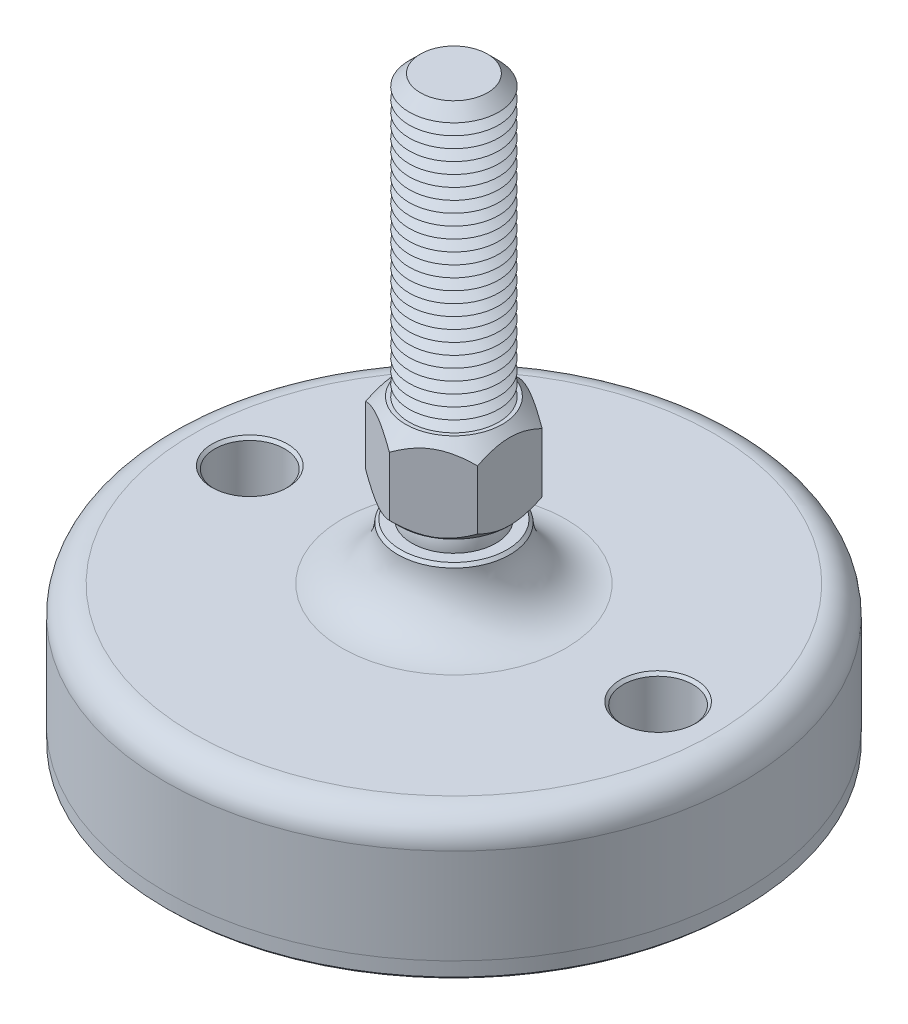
ISO-10303-21;
HEADER;
FILE_DESCRIPTION(('STEP AP214'),'2;1');
FILE_NAME('part.step','',(''),(''),'','','');
FILE_SCHEMA(('AUTOMOTIVE_DESIGN { 1 0 10303 214 1 1 1 1 }'));
ENDSEC;
DATA;
#1=APPLICATION_CONTEXT('core data for automotive mechanical design processes');
#2=APPLICATION_PROTOCOL_DEFINITION('international standard','automotive_design',2000,#1);
#3=PRODUCT_CONTEXT('',#1,'mechanical');
#4=PRODUCT('Part','Part','',(#3));
#5=PRODUCT_RELATED_PRODUCT_CATEGORY('part','',(#4));
#6=PRODUCT_DEFINITION_FORMATION('','',#4);
#7=PRODUCT_DEFINITION_CONTEXT('part definition',#1,'design');
#8=PRODUCT_DEFINITION('design','',#6,#7);
#9=PRODUCT_DEFINITION_SHAPE('','',#8);
#10=(LENGTH_UNIT() NAMED_UNIT(*) SI_UNIT(.MILLI.,.METRE.));
#11=(NAMED_UNIT(*) PLANE_ANGLE_UNIT() SI_UNIT($,.RADIAN.));
#12=(NAMED_UNIT(*) SI_UNIT($,.STERADIAN.) SOLID_ANGLE_UNIT());
#13=UNCERTAINTY_MEASURE_WITH_UNIT(LENGTH_MEASURE(1.E-05),#10,'distance_accuracy_value','');
#14=(GEOMETRIC_REPRESENTATION_CONTEXT(3) GLOBAL_UNCERTAINTY_ASSIGNED_CONTEXT((#13)) GLOBAL_UNIT_ASSIGNED_CONTEXT((#10,
#11,#12)) REPRESENTATION_CONTEXT('',''));
#15=CARTESIAN_POINT('',(0.,0.,0.));
#16=DIRECTION('',(0.,0.,1.));
#17=DIRECTION('',(1.,0.,0.));
#18=AXIS2_PLACEMENT_3D('',#15,#16,#17);
#19=CARTESIAN_POINT('',(0.,-32.,0.));
#20=DIRECTION('',(0.,1.,0.));
#21=DIRECTION('',(0.,0.,1.));
#22=AXIS2_PLACEMENT_3D('',#19,#20,#21);
#23=PLANE('',#22);
#24=CARTESIAN_POINT('',(-36.5,-32.,0.));
#25=DIRECTION('',(0.,1.,0.));
#26=DIRECTION('',(0.,0.,1.));
#27=AXIS2_PLACEMENT_3D('',#24,#25,#26);
#28=CIRCLE('',#27,6.25);
#29=CARTESIAN_POINT('',(-36.5,-32.,6.25));
#30=VERTEX_POINT('',#29);
#31=EDGE_CURVE('P0_E43',#30,#30,#28,.T.);
#32=ORIENTED_EDGE('',*,*,#31,.F.);
#33=EDGE_LOOP('',(#32));
#34=FACE_BOUND('',#33,.T.);
#35=CARTESIAN_POINT('',(36.5,-32.,0.));
#36=DIRECTION('',(0.,1.,0.));
#37=DIRECTION('',(0.,0.,1.));
#38=AXIS2_PLACEMENT_3D('',#35,#36,#37);
#39=CIRCLE('',#38,6.25);
#40=CARTESIAN_POINT('',(36.5,-32.,6.25));
#41=VERTEX_POINT('',#40);
#42=EDGE_CURVE('P0_E44',#41,#41,#39,.T.);
#43=ORIENTED_EDGE('',*,*,#42,.F.);
#44=EDGE_LOOP('',(#43));
#45=FACE_BOUND('',#44,.T.);
#46=CARTESIAN_POINT('',(0.,-32.,0.));
#47=DIRECTION('',(0.,1.,0.));
#48=DIRECTION('',(0.,0.,1.));
#49=AXIS2_PLACEMENT_3D('',#46,#47,#48);
#50=CIRCLE('',#49,51.5);
#51=CARTESIAN_POINT('',(0.,-32.,51.5));
#52=VERTEX_POINT('',#51);
#53=EDGE_CURVE('P0_E40',#52,#52,#50,.T.);
#54=ORIENTED_EDGE('',*,*,#53,.T.);
#55=EDGE_LOOP('',(#54));
#56=FACE_BOUND('',#55,.T.);
#57=ADVANCED_FACE('P0_F14',(#34,#45,#56),#23,.T.);
#58=CARTESIAN_POINT('',(0.,43.1654938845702,0.));
#59=DIRECTION('',(0.,1.,0.));
#60=DIRECTION('',(0.,0.,1.));
#61=AXIS2_PLACEMENT_3D('',#58,#59,#60);
#62=CYLINDRICAL_SURFACE('',#61,51.5);
#63=CARTESIAN_POINT('',(0.,-34.5,0.));
#64=DIRECTION('',(0.,-1.,0.));
#65=DIRECTION('',(0.,0.,-1.));
#66=AXIS2_PLACEMENT_3D('',#63,#64,#65);
#67=CIRCLE('',#66,51.5);
#68=CARTESIAN_POINT('',(0.,-34.5,-51.5));
#69=VERTEX_POINT('',#68);
#70=EDGE_CURVE('P0_E37',#69,#69,#67,.F.);
#71=ORIENTED_EDGE('',*,*,#70,.T.);
#72=EDGE_LOOP('',(#71));
#73=FACE_BOUND('',#72,.T.);
#74=ORIENTED_EDGE('',*,*,#53,.F.);
#75=EDGE_LOOP('',(#74));
#76=FACE_BOUND('',#75,.T.);
#77=ADVANCED_FACE('P0_F54',(#73,#76),#62,.T.);
#78=CARTESIAN_POINT('',(0.,-35.,51.5));
#79=DIRECTION('',(0.,-1.,0.));
#80=DIRECTION('',(0.,0.,-1.));
#81=AXIS2_PLACEMENT_3D('',#78,#79,#80);
#82=PLANE('',#81);
#83=CARTESIAN_POINT('',(36.5,-35.,0.));
#84=DIRECTION('',(0.,-1.,0.));
#85=DIRECTION('',(0.,0.,-1.));
#86=AXIS2_PLACEMENT_3D('',#83,#84,#85);
#87=CIRCLE('',#86,6.75000000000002);
#88=CARTESIAN_POINT('',(36.5,-35.,-6.75000000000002));
#89=VERTEX_POINT('',#88);
#90=EDGE_CURVE('P0_E25',#89,#89,#87,.F.);
#91=ORIENTED_EDGE('',*,*,#90,.T.);
#92=EDGE_LOOP('',(#91));
#93=FACE_BOUND('',#92,.T.);
#94=CARTESIAN_POINT('',(-36.5,-35.,0.));
#95=DIRECTION('',(0.,-1.,0.));
#96=DIRECTION('',(0.,0.,-1.));
#97=AXIS2_PLACEMENT_3D('',#94,#95,#96);
#98=CIRCLE('',#97,6.74999999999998);
#99=CARTESIAN_POINT('',(-36.5,-35.,-6.74999999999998));
#100=VERTEX_POINT('',#99);
#101=EDGE_CURVE('P0_E29',#100,#100,#98,.F.);
#102=ORIENTED_EDGE('',*,*,#101,.T.);
#103=EDGE_LOOP('',(#102));
#104=FACE_BOUND('',#103,.T.);
#105=CARTESIAN_POINT('',(0.,-35.,0.));
#106=DIRECTION('',(0.,-1.,0.));
#107=DIRECTION('',(0.,0.,-1.));
#108=AXIS2_PLACEMENT_3D('',#105,#106,#107);
#109=CIRCLE('',#108,51.);
#110=CARTESIAN_POINT('',(0.,-35.,-51.));
#111=VERTEX_POINT('',#110);
#112=EDGE_CURVE('P0_E34',#111,#111,#109,.T.);
#113=ORIENTED_EDGE('',*,*,#112,.T.);
#114=EDGE_LOOP('',(#113));
#115=FACE_BOUND('',#114,.T.);
#116=ADVANCED_FACE('P0_F61',(#93,#104,#115),#82,.T.);
#117=CARTESIAN_POINT('',(0.,-34.5,0.));
#118=DIRECTION('',(0.,1.,0.));
#119=DIRECTION('',(0.,0.,1.));
#120=AXIS2_PLACEMENT_3D('',#117,#118,#119);
#121=CONICAL_SURFACE('',#120,51.5,0.785398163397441);
#122=ORIENTED_EDGE('',*,*,#112,.F.);
#123=EDGE_LOOP('',(#122));
#124=FACE_BOUND('',#123,.T.);
#125=ORIENTED_EDGE('',*,*,#70,.F.);
#126=EDGE_LOOP('',(#125));
#127=FACE_BOUND('',#126,.T.);
#128=ADVANCED_FACE('P0_F68',(#124,#127),#121,.T.);
#129=CARTESIAN_POINT('',(36.5,-35.,0.));
#130=DIRECTION('',(0.,1.,0.));
#131=DIRECTION('',(0.,0.,1.));
#132=AXIS2_PLACEMENT_3D('',#129,#130,#131);
#133=CYLINDRICAL_SURFACE('',#132,6.25);
#134=CARTESIAN_POINT('',(36.5,-34.5,0.));
#135=DIRECTION('',(0.,-1.,0.));
#136=DIRECTION('',(0.,0.,-1.));
#137=AXIS2_PLACEMENT_3D('',#134,#135,#136);
#138=CIRCLE('',#137,6.25);
#139=CARTESIAN_POINT('',(36.5,-34.5,-6.25));
#140=VERTEX_POINT('',#139);
#141=EDGE_CURVE('P0_E21',#140,#140,#138,.T.);
#142=ORIENTED_EDGE('',*,*,#141,.T.);
#143=EDGE_LOOP('',(#142));
#144=FACE_BOUND('',#143,.T.);
#145=ORIENTED_EDGE('',*,*,#42,.T.);
#146=EDGE_LOOP('',(#145));
#147=FACE_BOUND('',#146,.T.);
#148=ADVANCED_FACE('P0_F74',(#144,#147),#133,.F.);
#149=CARTESIAN_POINT('',(-36.5,-35.,0.));
#150=DIRECTION('',(0.,1.,0.));
#151=DIRECTION('',(0.,0.,1.));
#152=AXIS2_PLACEMENT_3D('',#149,#150,#151);
#153=CYLINDRICAL_SURFACE('',#152,6.25);
#154=CARTESIAN_POINT('',(-36.5,-34.5,0.));
#155=DIRECTION('',(0.,-1.,0.));
#156=DIRECTION('',(0.,0.,-1.));
#157=AXIS2_PLACEMENT_3D('',#154,#155,#156);
#158=CIRCLE('',#157,6.25);
#159=CARTESIAN_POINT('',(-36.5,-34.5,-6.25));
#160=VERTEX_POINT('',#159);
#161=EDGE_CURVE('P0_E10',#160,#160,#158,.T.);
#162=ORIENTED_EDGE('',*,*,#161,.T.);
#163=EDGE_LOOP('',(#162));
#164=FACE_BOUND('',#163,.T.);
#165=ORIENTED_EDGE('',*,*,#31,.T.);
#166=EDGE_LOOP('',(#165));
#167=FACE_BOUND('',#166,.T.);
#168=ADVANCED_FACE('P0_F50',(#164,#167),#153,.F.);
#169=CARTESIAN_POINT('',(36.5,-35.,0.));
#170=DIRECTION('',(0.,-1.,0.));
#171=DIRECTION('',(0.,0.,-1.));
#172=AXIS2_PLACEMENT_3D('',#169,#170,#171);
#173=CONICAL_SURFACE('',#172,6.75000000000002,0.785398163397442);
#174=ORIENTED_EDGE('',*,*,#141,.F.);
#175=EDGE_LOOP('',(#174));
#176=FACE_BOUND('',#175,.T.);
#177=ORIENTED_EDGE('',*,*,#90,.F.);
#178=EDGE_LOOP('',(#177));
#179=FACE_BOUND('',#178,.T.);
#180=ADVANCED_FACE('P0_F76',(#176,#179),#173,.F.);
#181=CARTESIAN_POINT('',(-36.5,-35.,0.));
#182=DIRECTION('',(0.,-1.,0.));
#183=DIRECTION('',(0.,0.,-1.));
#184=AXIS2_PLACEMENT_3D('',#181,#182,#183);
#185=CONICAL_SURFACE('',#184,6.74999999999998,0.785398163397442);
#186=ORIENTED_EDGE('',*,*,#161,.F.);
#187=EDGE_LOOP('',(#186));
#188=FACE_BOUND('',#187,.T.);
#189=ORIENTED_EDGE('',*,*,#101,.F.);
#190=EDGE_LOOP('',(#189));
#191=FACE_BOUND('',#190,.T.);
#192=ADVANCED_FACE('P0_F16',(#188,#191),#185,.F.);
#193=CLOSED_SHELL('',(#57,#77,#116,#128,#148,#168,#180,#192));
#194=MANIFOLD_SOLID_BREP('P0_B1',#193);
#195=CARTESIAN_POINT('',(0.,3.75,0.));
#196=DIRECTION('',(0.,1.,0.));
#197=DIRECTION('',(0.,0.,1.));
#198=AXIS2_PLACEMENT_3D('',#195,#196,#197);
#199=PLANE('',#198);
#200=CARTESIAN_POINT('',(0.,3.75,0.));
#201=DIRECTION('',(0.,1.,0.));
#202=DIRECTION('',(0.,0.,1.));
#203=AXIS2_PLACEMENT_3D('',#200,#201,#202);
#204=CIRCLE('',#203,9.72829454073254);
#205=CARTESIAN_POINT('',(0.,3.75,9.72829454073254));
#206=VERTEX_POINT('',#205);
#207=EDGE_CURVE('P1_E221',#206,#206,#204,.T.);
#208=ORIENTED_EDGE('',*,*,#207,.F.);
#209=EDGE_LOOP('',(#208));
#210=FACE_BOUND('',#209,.T.);
#211=CARTESIAN_POINT('',(0.,3.75,0.));
#212=DIRECTION('',(0.,1.,0.));
#213=DIRECTION('',(0.,0.,1.));
#214=AXIS2_PLACEMENT_3D('',#211,#212,#213);
#215=CIRCLE('',#214,6.49519052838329);
#216=CARTESIAN_POINT('',(0.,3.75,6.49519052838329));
#217=VERTEX_POINT('',#216);
#218=EDGE_CURVE('P1_E24',#217,#217,#215,.F.);
#219=ORIENTED_EDGE('',*,*,#218,.F.);
#220=EDGE_LOOP('',(#219));
#221=FACE_BOUND('',#220,.T.);
#222=ADVANCED_FACE('P1_F16',(#210,#221),#199,.F.);
#223=CARTESIAN_POINT('',(0.,0.,0.));
#224=DIRECTION('',(0.,1.,0.));
#225=DIRECTION('',(0.,0.,-1.));
#226=AXIS2_PLACEMENT_3D('',#223,#224,#225);
#227=SPHERICAL_SURFACE('',#226,7.5);
#228=ORIENTED_EDGE('',*,*,#218,.T.);
#229=EDGE_LOOP('',(#228));
#230=FACE_BOUND('',#229,.T.);
#231=ADVANCED_FACE('P1_F203',(#230),#227,.T.);
#232=CARTESIAN_POINT('',(0.,3.75,0.));
#233=DIRECTION('',(0.,1.,0.));
#234=DIRECTION('',(0.,0.,1.));
#235=AXIS2_PLACEMENT_3D('',#232,#233,#234);
#236=CONICAL_SURFACE('',#235,9.72829454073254,0.785398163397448);
#237=ORIENTED_EDGE('',*,*,#207,.T.);
#238=EDGE_LOOP('',(#237));
#239=FACE_BOUND('',#238,.T.);
#240=CARTESIAN_POINT('',(-10.,9.59571642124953,-11.9394228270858));
#241=CARTESIAN_POINT('',(-10.,9.37430561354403,-11.6505452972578));
#242=CARTESIAN_POINT('',(-10.,9.15490936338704,-11.3600988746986));
#243=CARTESIAN_POINT('',(-10.,8.72106267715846,-10.7754314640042));
#244=CARTESIAN_POINT('',(-10.,8.50661343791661,-10.4812095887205));
#245=CARTESIAN_POINT('',(-10.,8.08205114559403,-9.88620330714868));
#246=CARTESIAN_POINT('',(-10.,7.87198437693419,-9.58538576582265));
#247=CARTESIAN_POINT('',(-10.,7.45926520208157,-8.97872312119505));
#248=CARTESIAN_POINT('',(-10.,7.25661228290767,-8.67287836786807));
#249=CARTESIAN_POINT('',(-10.,6.84809543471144,-8.03614350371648));
#250=CARTESIAN_POINT('',(-10.,6.64281401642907,-7.70487777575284));
#251=CARTESIAN_POINT('',(-10.,6.245142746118,-7.03457466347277));
#252=CARTESIAN_POINT('',(-10.,6.0527550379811,-6.69553599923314));
#253=CARTESIAN_POINT('',(-10.,5.68497951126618,-6.00961937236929));
#254=CARTESIAN_POINT('',(-10.,5.50954176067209,-5.66276839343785));
#255=CARTESIAN_POINT('',(-10.,5.17959635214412,-4.95932933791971));
#256=CARTESIAN_POINT('',(-10.,5.02507889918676,-4.60274591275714));
#257=CARTESIAN_POINT('',(-10.,4.75599518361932,-3.91353381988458));
#258=CARTESIAN_POINT('',(-10.,4.63902686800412,-3.58185263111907));
#259=CARTESIAN_POINT('',(-10.,4.43164927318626,-2.91013341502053));
#260=CARTESIAN_POINT('',(-10.,4.34124171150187,-2.57009484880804));
#261=CARTESIAN_POINT('',(-10.,4.19334931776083,-1.88955843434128));
#262=CARTESIAN_POINT('',(-10.,4.13527351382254,-1.54919119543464));
#263=CARTESIAN_POINT('',(-10.,4.05324021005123,-0.864347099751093));
#264=CARTESIAN_POINT('',(-10.,4.029275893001,-0.519871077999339));
#265=CARTESIAN_POINT('',(-10.,4.01745435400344,0.155191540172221));
#266=CARTESIAN_POINT('',(-10.,4.02812008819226,0.485752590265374));
#267=CARTESIAN_POINT('',(-10.,4.08160326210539,1.1442457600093));
#268=CARTESIAN_POINT('',(-10.,4.12442366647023,1.47217763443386));
#269=CARTESIAN_POINT('',(-10.,4.24054019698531,2.12859326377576));
#270=CARTESIAN_POINT('',(-10.,4.31437036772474,2.45698095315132));
#271=CARTESIAN_POINT('',(-10.,4.48844287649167,3.10654175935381));
#272=CARTESIAN_POINT('',(-10.,4.58868356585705,3.42771532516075));
#273=CARTESIAN_POINT('',(-10.,4.81839210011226,4.08271396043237));
#274=CARTESIAN_POINT('',(-10.,4.94932842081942,4.41601827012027));
#275=CARTESIAN_POINT('',(-10.,5.23140828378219,5.07403931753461));
#276=CARTESIAN_POINT('',(-10.,5.38256099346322,5.3987520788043));
#277=CARTESIAN_POINT('',(-10.,5.70148727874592,6.04113299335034));
#278=CARTESIAN_POINT('',(-10.,5.86931223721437,6.35877542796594));
#279=CARTESIAN_POINT('',(-10.,6.21788686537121,6.98677627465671));
#280=CARTESIAN_POINT('',(-10.,6.39863453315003,7.29713580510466));
#281=CARTESIAN_POINT('',(-10.,6.76133545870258,7.89633938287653));
#282=CARTESIAN_POINT('',(-10.,6.94278731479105,8.18548854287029));
#283=CARTESIAN_POINT('',(-10.,7.31339871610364,8.75881961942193));
#284=CARTESIAN_POINT('',(-10.,7.50255884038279,9.04300116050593));
#285=CARTESIAN_POINT('',(-10.,7.8856676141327,9.6047584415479));
#286=CARTESIAN_POINT('',(-10.,8.07956548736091,9.88236893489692));
#287=CARTESIAN_POINT('',(-10.,8.47254700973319,10.4337838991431));
#288=CARTESIAN_POINT('',(-10.,8.67162921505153,10.7075893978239));
#289=CARTESIAN_POINT('',(-10.,8.87283307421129,10.9797992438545));
#290=B_SPLINE_CURVE_WITH_KNOTS('',3,(#240,#241,#242,#243,#244,#245,#246,#247,#248,#249,#250,
#251,#252,#253,#254,#255,#256,#257,#258,#259,#260,#261,#262,#263,#264,#265,#266,#267,#268,#269,
#270,#271,#272,#273,#274,#275,#276,#277,#278,#279,#280,#281,#282,#283,#284,#285,#286,#287,#288,
#289),.UNSPECIFIED.,.F.,.F.,(4,2,2,2,2,2,2,2,2,2,2,2,2,2,2,2,2,2,2,2,2,2,2,2,4),(0.,
1.09192545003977,2.18411235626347,3.28473497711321,4.3852812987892,5.5541916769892,
6.72329593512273,7.88884387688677,9.05384420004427,10.1080362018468,11.1622963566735,
12.1965943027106,13.2306855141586,14.2212593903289,15.2119246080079,16.2203997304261,
17.2288119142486,18.3022883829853,19.3762532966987,20.4536373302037,21.5308548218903,
22.5548150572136,23.5788523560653,24.5946500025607,25.6101677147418),.UNSPECIFIED.);
#291=CARTESIAN_POINT('',(-10.,5.56871084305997,-5.77350269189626));
#292=VERTEX_POINT('',#291);
#293=CARTESIAN_POINT('',(-10.,5.56871084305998,5.77350269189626));
#294=VERTEX_POINT('',#293);
#295=EDGE_CURVE('P1_E186',#292,#294,#290,.T.);
#296=ORIENTED_EDGE('',*,*,#295,.F.);
#297=CARTESIAN_POINT('',(0.000199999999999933,5.56882631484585,-11.5471208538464));
#298=CARTESIAN_POINT('',(-0.171722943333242,5.4695807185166,-11.447861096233));
#299=CARTESIAN_POINT('',(-0.344992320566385,5.37336355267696,-11.3478239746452));
#300=CARTESIAN_POINT('',(-0.694433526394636,5.18794806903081,-11.1460740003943));
#301=CARTESIAN_POINT('',(-0.870606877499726,5.09875358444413,-11.0443602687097));
#302=CARTESIAN_POINT('',(-1.22689656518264,4.92796770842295,-10.8386563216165));
#303=CARTESIAN_POINT('',(-1.40702970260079,4.84642277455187,-10.7346564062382));
#304=CARTESIAN_POINT('',(-1.77025459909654,4.69270708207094,-10.52494841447));
#305=CARTESIAN_POINT('',(-1.95334590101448,4.62053489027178,-10.4192406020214));
#306=CARTESIAN_POINT('',(-2.31954331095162,4.4878482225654,-10.2078164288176));
#307=CARTESIAN_POINT('',(-2.50260441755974,4.42716910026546,-10.1021260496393));
#308=CARTESIAN_POINT('',(-2.87129282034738,4.31731511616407,-9.88926370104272));
#309=CARTESIAN_POINT('',(-3.05691983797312,4.26813901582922,-9.78209189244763));
#310=CARTESIAN_POINT('',(-3.42994608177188,4.1825291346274,-9.56672509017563));
#311=CARTESIAN_POINT('',(-3.61734032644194,4.14606667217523,-9.45853297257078));
#312=CARTESIAN_POINT('',(-3.99370204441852,4.08668528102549,-9.24124043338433));
#313=CARTESIAN_POINT('',(-4.1826692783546,4.06376432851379,-9.13214015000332));
#314=CARTESIAN_POINT('',(-4.64316633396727,4.0253323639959,-8.86627205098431));
#315=CARTESIAN_POINT('',(-4.91519388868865,4.01726744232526,-8.70921686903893));
#316=CARTESIAN_POINT('',(-5.45875701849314,4.03080424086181,-8.39539054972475));
#317=CARTESIAN_POINT('',(-5.7302923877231,4.05241636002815,-8.23861953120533));
#318=CARTESIAN_POINT('',(-6.27080349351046,4.12403157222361,-7.92655529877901));
#319=CARTESIAN_POINT('',(-6.53977602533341,4.17406641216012,-7.77126393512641));
#320=CARTESIAN_POINT('',(-7.07309796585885,4.29980733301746,-7.46335036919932));
#321=CARTESIAN_POINT('',(-7.33744772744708,4.3755114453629,-7.31072796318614));
#322=CARTESIAN_POINT('',(-7.80670351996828,4.53125365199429,-7.03980300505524));
#323=CARTESIAN_POINT('',(-8.01264886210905,4.60719488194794,-6.92090040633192));
#324=CARTESIAN_POINT('',(-8.42084280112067,4.77131434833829,-6.68522952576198));
#325=CARTESIAN_POINT('',(-8.62309128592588,4.85949295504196,-6.5684613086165));
#326=CARTESIAN_POINT('',(-9.02325448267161,5.04611070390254,-6.33742697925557));
#327=CARTESIAN_POINT('',(-9.22118057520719,5.1445175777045,-6.2231542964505));
#328=CARTESIAN_POINT('',(-9.61336795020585,5.35030005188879,-5.99672480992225));
#329=CARTESIAN_POINT('',(-9.80763139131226,5.45767015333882,-5.88456675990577));
#330=CARTESIAN_POINT('',(-10.0002,5.56882631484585,-5.77338722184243));
#331=B_SPLINE_CURVE_WITH_KNOTS('',3,(#297,#298,#299,#300,#301,#302,#303,#304,#305,#306,#307,
#308,#309,#310,#311,#312,#313,#314,#315,#316,#317,#318,#319,#320,#321,#322,#323,#324,#325,#326,
#327,#328,#329,#330),.UNSPECIFIED.,.F.,.F.,(4,2,2,2,2,2,2,2,2,2,2,2,2,2,2,2,4),(0.,
0.665863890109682,1.33208874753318,2.00212824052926,2.67206515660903,3.33152613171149,
3.99091606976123,4.64880867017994,5.30660292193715,6.24777541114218,7.18927777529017,
8.13183382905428,9.07431761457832,9.82287578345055,10.5714566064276,11.3177436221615,
12.0635761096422),.UNSPECIFIED.);
#332=CARTESIAN_POINT('',(0.,5.56871084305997,-11.5470053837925));
#333=VERTEX_POINT('',#332);
#334=EDGE_CURVE('P1_E180',#333,#292,#331,.T.);
#335=ORIENTED_EDGE('',*,*,#334,.F.);
#336=CARTESIAN_POINT('',(10.0002,5.56882631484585,-5.77338722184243));
#337=CARTESIAN_POINT('',(9.82827705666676,5.4695807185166,-5.87264697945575));
#338=CARTESIAN_POINT('',(9.65500767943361,5.37336355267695,-5.97268410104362));
#339=CARTESIAN_POINT('',(9.30556647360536,5.18794806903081,-6.17443407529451));
#340=CARTESIAN_POINT('',(9.12939312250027,5.09875358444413,-6.27614780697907));
#341=CARTESIAN_POINT('',(8.77310343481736,4.92796770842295,-6.48185175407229));
#342=CARTESIAN_POINT('',(8.59297029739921,4.84642277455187,-6.58585166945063));
#343=CARTESIAN_POINT('',(8.22974540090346,4.69270708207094,-6.79555966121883));
#344=CARTESIAN_POINT('',(8.04665409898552,4.62053489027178,-6.90126747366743));
#345=CARTESIAN_POINT('',(7.68045668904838,4.4878482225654,-7.11269164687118));
#346=CARTESIAN_POINT('',(7.49739558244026,4.42716910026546,-7.21838202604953));
#347=CARTESIAN_POINT('',(7.12870717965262,4.31731511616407,-7.43124437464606));
#348=CARTESIAN_POINT('',(6.94308016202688,4.26813901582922,-7.53841618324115));
#349=CARTESIAN_POINT('',(6.57005391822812,4.1825291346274,-7.75378298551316));
#350=CARTESIAN_POINT('',(6.38265967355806,4.14606667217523,-7.861975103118));
#351=CARTESIAN_POINT('',(6.00629795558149,4.08668528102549,-8.07926764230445));
#352=CARTESIAN_POINT('',(5.81733072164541,4.06376432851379,-8.18836792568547));
#353=CARTESIAN_POINT('',(5.35683366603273,4.0253323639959,-8.45423602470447));
#354=CARTESIAN_POINT('',(5.08480611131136,4.01726744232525,-8.61129120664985));
#355=CARTESIAN_POINT('',(4.54124298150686,4.03080424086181,-8.92511752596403));
#356=CARTESIAN_POINT('',(4.2697076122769,4.05241636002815,-9.08188854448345));
#357=CARTESIAN_POINT('',(3.72919650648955,4.12403157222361,-9.39395277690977));
#358=CARTESIAN_POINT('',(3.46022397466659,4.17406641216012,-9.54924414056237));
#359=CARTESIAN_POINT('',(2.92690203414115,4.29980733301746,-9.85715770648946));
#360=CARTESIAN_POINT('',(2.66255227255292,4.37551144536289,-10.0097801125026));
#361=CARTESIAN_POINT('',(2.19329648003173,4.53125365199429,-10.2807050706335));
#362=CARTESIAN_POINT('',(1.98735113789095,4.60719488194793,-10.3996076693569));
#363=CARTESIAN_POINT('',(1.57915719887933,4.77131434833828,-10.6352785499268));
#364=CARTESIAN_POINT('',(1.37690871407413,4.85949295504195,-10.7520467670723));
#365=CARTESIAN_POINT('',(0.976745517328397,5.04611070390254,-10.9830810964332));
#366=CARTESIAN_POINT('',(0.77881942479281,5.1445175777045,-11.0973537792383));
#367=CARTESIAN_POINT('',(0.386632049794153,5.35030005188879,-11.3237832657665));
#368=CARTESIAN_POINT('',(0.192368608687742,5.45767015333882,-11.435941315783));
#369=CARTESIAN_POINT('',(-0.000199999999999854,5.56882631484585,-11.5471208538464));
#370=B_SPLINE_CURVE_WITH_KNOTS('',3,(#336,#337,#338,#339,#340,#341,#342,#343,#344,#345,#346,
#347,#348,#349,#350,#351,#352,#353,#354,#355,#356,#357,#358,#359,#360,#361,#362,#363,#364,#365,
#366,#367,#368,#369),.UNSPECIFIED.,.F.,.F.,(4,2,2,2,2,2,2,2,2,2,2,2,2,2,2,2,4),(0.,
0.665863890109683,1.33208874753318,2.00212824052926,2.67206515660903,3.33152613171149,
3.99091606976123,4.64880867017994,5.30660292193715,6.24777541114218,7.18927777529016,
8.13183382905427,9.07431761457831,9.82287578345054,10.5714566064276,11.3177436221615,
12.0635761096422),.UNSPECIFIED.);
#371=CARTESIAN_POINT('',(9.99999999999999,5.56871084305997,-5.77350269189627));
#372=VERTEX_POINT('',#371);
#373=EDGE_CURVE('P1_E168',#372,#333,#370,.T.);
#374=ORIENTED_EDGE('',*,*,#373,.F.);
#375=CARTESIAN_POINT('',(10.,9.59571642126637,-11.9394228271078));
#376=CARTESIAN_POINT('',(10.,9.37430561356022,-11.6505452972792));
#377=CARTESIAN_POINT('',(10.,9.15490936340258,-11.3600988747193));
#378=CARTESIAN_POINT('',(10.,8.7210626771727,-10.7754314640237));
#379=CARTESIAN_POINT('',(10.,8.5066134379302,-10.4812095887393));
#380=CARTESIAN_POINT('',(10.,8.08205114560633,-9.88620330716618));
#381=CARTESIAN_POINT('',(10.,7.87198437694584,-9.58538576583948));
#382=CARTESIAN_POINT('',(10.,7.45926520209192,-8.97872312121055));
#383=CARTESIAN_POINT('',(10.,7.25661228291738,-8.67287836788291));
#384=CARTESIAN_POINT('',(10.,6.84809543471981,-8.03614350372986));
#385=CARTESIAN_POINT('',(10.,6.64281401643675,-7.70487777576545));
#386=CARTESIAN_POINT('',(10.,6.24514274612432,-7.03457466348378));
#387=CARTESIAN_POINT('',(10.,6.05275503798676,-6.69553599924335));
#388=CARTESIAN_POINT('',(10.,5.68497951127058,-6.00961937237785));
#389=CARTESIAN_POINT('',(10.,5.50954176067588,-5.66276839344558));
#390=CARTESIAN_POINT('',(10.,5.17959635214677,-4.95932933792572));
#391=CARTESIAN_POINT('',(10.,5.02507889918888,-4.60274591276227));
#392=CARTESIAN_POINT('',(10.,4.75599518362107,-3.91353381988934));
#393=CARTESIAN_POINT('',(10.,4.63902686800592,-3.58185263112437));
#394=CARTESIAN_POINT('',(10.,4.43164927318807,-2.91013341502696));
#395=CARTESIAN_POINT('',(10.,4.34124171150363,-2.57009484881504));
#396=CARTESIAN_POINT('',(10.,4.19334931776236,-1.8895584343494));
#397=CARTESIAN_POINT('',(10.,4.13527351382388,-1.54919119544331));
#398=CARTESIAN_POINT('',(10.,4.05324021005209,-0.86434709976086));
#399=CARTESIAN_POINT('',(10.,4.02927589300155,-0.519871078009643));
#400=CARTESIAN_POINT('',(10.,4.01745435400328,0.155191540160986));
#401=CARTESIAN_POINT('',(10.,4.0281200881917,0.485752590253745));
#402=CARTESIAN_POINT('',(10.,4.08160326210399,1.14424575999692));
#403=CARTESIAN_POINT('',(10.,4.12442366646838,1.47217763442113));
#404=CARTESIAN_POINT('',(10.,4.24054019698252,2.12859326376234));
#405=CARTESIAN_POINT('',(10.,4.31437036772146,2.45698095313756));
#406=CARTESIAN_POINT('',(10.,4.48844287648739,3.1065417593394));
#407=CARTESIAN_POINT('',(10.,4.58868356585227,3.42771532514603));
#408=CARTESIAN_POINT('',(10.,4.81839210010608,4.08271396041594));
#409=CARTESIAN_POINT('',(10.,4.94932842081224,4.41601827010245));
#410=CARTESIAN_POINT('',(10.,5.23140828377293,5.0740393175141));
#411=CARTESIAN_POINT('',(10.,5.38256099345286,5.39875207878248));
#412=CARTESIAN_POINT('',(10.,5.70148727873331,6.04113299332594));
#413=CARTESIAN_POINT('',(10.,5.86931223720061,6.35877542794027));
#414=CARTESIAN_POINT('',(10.,6.21788686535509,6.98677627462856));
#415=CARTESIAN_POINT('',(10.,6.39863453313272,7.29713580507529));
#416=CARTESIAN_POINT('',(10.,6.761335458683,7.89633938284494));
#417=CARTESIAN_POINT('',(10.,6.9427873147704,8.18548854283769));
#418=CARTESIAN_POINT('',(10.,7.31339871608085,8.75881961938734));
#419=CARTESIAN_POINT('',(10.,7.50255884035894,9.04300116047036));
#420=CARTESIAN_POINT('',(10.,7.88566761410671,9.60475844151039));
#421=CARTESIAN_POINT('',(10.,8.07956548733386,9.88236893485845));
#422=CARTESIAN_POINT('',(10.,8.47254700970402,10.4337838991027));
#423=CARTESIAN_POINT('',(10.,8.6716292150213,10.7075893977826));
#424=CARTESIAN_POINT('',(10.,8.87283307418,10.9797992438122));
#425=B_SPLINE_CURVE_WITH_KNOTS('',3,(#375,#376,#377,#378,#379,#380,#381,#382,#383,#384,#385,
#386,#387,#388,#389,#390,#391,#392,#393,#394,#395,#396,#397,#398,#399,#400,#401,#402,#403,#404,
#405,#406,#407,#408,#409,#410,#411,#412,#413,#414,#415,#416,#417,#418,#419,#420,#421,#422,#423,
#424),.UNSPECIFIED.,.F.,.F.,(4,2,2,2,2,2,2,2,2,2,2,2,2,2,2,2,2,2,2,2,2,2,2,2,4),(0.,
1.09192545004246,2.18411235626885,3.28473497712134,4.38528129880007,5.55419167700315,
6.72329593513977,7.88884387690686,9.05384420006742,10.1080362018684,11.1622963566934,
12.196594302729,13.2306855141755,14.2212593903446,15.2119246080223,16.2203997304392,
17.2288119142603,18.3022883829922,19.3762532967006,20.4536373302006,21.5308548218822,
22.5548150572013,23.5788523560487,24.5946500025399,25.6101677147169),.UNSPECIFIED.);
#426=CARTESIAN_POINT('',(10.,5.56871084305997,5.77350269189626));
#427=VERTEX_POINT('',#426);
#428=EDGE_CURVE('P1_E70',#427,#372,#425,.F.);
#429=ORIENTED_EDGE('',*,*,#428,.F.);
#430=CARTESIAN_POINT('',(-0.000200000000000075,5.56882631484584,11.5471208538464));
#431=CARTESIAN_POINT('',(0.171722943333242,5.4695807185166,11.447861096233));
#432=CARTESIAN_POINT('',(0.344992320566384,5.37336355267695,11.3478239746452));
#433=CARTESIAN_POINT('',(0.694433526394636,5.18794806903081,11.1460740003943));
#434=CARTESIAN_POINT('',(0.870606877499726,5.09875358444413,11.0443602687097));
#435=CARTESIAN_POINT('',(1.22689656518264,4.92796770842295,10.8386563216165));
#436=CARTESIAN_POINT('',(1.40702970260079,4.84642277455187,10.7346564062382));
#437=CARTESIAN_POINT('',(1.77025459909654,4.69270708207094,10.52494841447));
#438=CARTESIAN_POINT('',(1.95334590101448,4.62053489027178,10.4192406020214));
#439=CARTESIAN_POINT('',(2.31954331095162,4.4878482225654,10.2078164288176));
#440=CARTESIAN_POINT('',(2.50260441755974,4.42716910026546,10.1021260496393));
#441=CARTESIAN_POINT('',(2.87129282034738,4.31731511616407,9.88926370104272));
#442=CARTESIAN_POINT('',(3.05691983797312,4.26813901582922,9.78209189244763));
#443=CARTESIAN_POINT('',(3.42994608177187,4.18252913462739,9.56672509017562));
#444=CARTESIAN_POINT('',(3.61734032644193,4.14606667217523,9.45853297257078));
#445=CARTESIAN_POINT('',(3.99370204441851,4.08668528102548,9.24124043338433));
#446=CARTESIAN_POINT('',(4.18266927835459,4.06376432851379,9.13214015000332));
#447=CARTESIAN_POINT('',(4.64316633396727,4.0253323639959,8.86627205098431));
#448=CARTESIAN_POINT('',(4.91519388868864,4.01726744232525,8.70921686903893));
#449=CARTESIAN_POINT('',(5.45875701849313,4.03080424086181,8.39539054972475));
#450=CARTESIAN_POINT('',(5.7302923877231,4.05241636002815,8.23861953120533));
#451=CARTESIAN_POINT('',(6.27080349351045,4.1240315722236,7.92655529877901));
#452=CARTESIAN_POINT('',(6.53977602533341,4.17406641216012,7.77126393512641));
#453=CARTESIAN_POINT('',(7.07309796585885,4.29980733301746,7.46335036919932));
#454=CARTESIAN_POINT('',(7.33744772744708,4.37551144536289,7.31072796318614));
#455=CARTESIAN_POINT('',(7.80670351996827,4.53125365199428,7.03980300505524));
#456=CARTESIAN_POINT('',(8.01264886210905,4.60719488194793,6.92090040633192));
#457=CARTESIAN_POINT('',(8.42084280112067,4.77131434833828,6.68522952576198));
#458=CARTESIAN_POINT('',(8.62309128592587,4.85949295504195,6.5684613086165));
#459=CARTESIAN_POINT('',(9.0232544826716,5.04611070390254,6.33742697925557));
#460=CARTESIAN_POINT('',(9.22118057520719,5.1445175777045,6.2231542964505));
#461=CARTESIAN_POINT('',(9.61336795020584,5.35030005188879,5.99672480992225));
#462=CARTESIAN_POINT('',(9.80763139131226,5.45767015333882,5.88456675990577));
#463=CARTESIAN_POINT('',(10.0002,5.56882631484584,5.77338722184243));
#464=B_SPLINE_CURVE_WITH_KNOTS('',3,(#430,#431,#432,#433,#434,#435,#436,#437,#438,#439,#440,
#441,#442,#443,#444,#445,#446,#447,#448,#449,#450,#451,#452,#453,#454,#455,#456,#457,#458,#459,
#460,#461,#462,#463),.UNSPECIFIED.,.F.,.F.,(4,2,2,2,2,2,2,2,2,2,2,2,2,2,2,2,4),(0.,
0.665863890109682,1.33208874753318,2.00212824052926,2.67206515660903,3.33152613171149,
3.99091606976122,4.64880867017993,5.30660292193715,6.24777541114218,7.18927777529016,
8.13183382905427,9.07431761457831,9.82287578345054,10.5714566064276,11.3177436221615,
12.0635761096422),.UNSPECIFIED.);
#465=CARTESIAN_POINT('',(0.,5.56871084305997,11.5470053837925));
#466=VERTEX_POINT('',#465);
#467=EDGE_CURVE('P1_E67',#466,#427,#464,.T.);
#468=ORIENTED_EDGE('',*,*,#467,.F.);
#469=CARTESIAN_POINT('',(-10.0002,5.56882631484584,5.77338722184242));
#470=CARTESIAN_POINT('',(-9.82827705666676,5.4695807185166,5.87264697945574));
#471=CARTESIAN_POINT('',(-9.65500767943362,5.37336355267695,5.97268410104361));
#472=CARTESIAN_POINT('',(-9.30556647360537,5.18794806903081,6.1744340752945));
#473=CARTESIAN_POINT('',(-9.12939312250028,5.09875358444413,6.27614780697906));
#474=CARTESIAN_POINT('',(-8.77310343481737,4.92796770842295,6.48185175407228));
#475=CARTESIAN_POINT('',(-8.59297029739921,4.84642277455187,6.58585166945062));
#476=CARTESIAN_POINT('',(-8.22974540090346,4.69270708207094,6.79555966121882));
#477=CARTESIAN_POINT('',(-8.04665409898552,4.62053489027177,6.90126747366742));
#478=CARTESIAN_POINT('',(-7.68045668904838,4.48784822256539,7.11269164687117));
#479=CARTESIAN_POINT('',(-7.49739558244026,4.42716910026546,7.21838202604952));
#480=CARTESIAN_POINT('',(-7.12870717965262,4.31731511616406,7.43124437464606));
#481=CARTESIAN_POINT('',(-6.94308016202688,4.26813901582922,7.53841618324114));
#482=CARTESIAN_POINT('',(-6.57005391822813,4.18252913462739,7.75378298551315));
#483=CARTESIAN_POINT('',(-6.38265967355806,4.14606667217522,7.861975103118));
#484=CARTESIAN_POINT('',(-6.00629795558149,4.08668528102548,8.07926764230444));
#485=CARTESIAN_POINT('',(-5.81733072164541,4.06376432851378,8.18836792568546));
#486=CARTESIAN_POINT('',(-5.35683366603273,4.0253323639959,8.45423602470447));
#487=CARTESIAN_POINT('',(-5.08480611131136,4.01726744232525,8.61129120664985));
#488=CARTESIAN_POINT('',(-4.54124298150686,4.0308042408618,8.92511752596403));
#489=CARTESIAN_POINT('',(-4.2697076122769,4.05241636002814,9.08188854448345));
#490=CARTESIAN_POINT('',(-3.72919650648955,4.1240315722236,9.39395277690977));
#491=CARTESIAN_POINT('',(-3.46022397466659,4.17406641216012,9.54924414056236));
#492=CARTESIAN_POINT('',(-2.92690203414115,4.29980733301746,9.85715770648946));
#493=CARTESIAN_POINT('',(-2.66255227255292,4.37551144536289,10.0097801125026));
#494=CARTESIAN_POINT('',(-2.19329648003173,4.53125365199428,10.2807050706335));
#495=CARTESIAN_POINT('',(-1.98735113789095,4.60719488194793,10.3996076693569));
#496=CARTESIAN_POINT('',(-1.57915719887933,4.77131434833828,10.6352785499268));
#497=CARTESIAN_POINT('',(-1.37690871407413,4.85949295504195,10.7520467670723));
#498=CARTESIAN_POINT('',(-0.976745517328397,5.04611070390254,10.9830810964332));
#499=CARTESIAN_POINT('',(-0.778819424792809,5.1445175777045,11.0973537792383));
#500=CARTESIAN_POINT('',(-0.386632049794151,5.35030005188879,11.3237832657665));
#501=CARTESIAN_POINT('',(-0.192368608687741,5.45767015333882,11.435941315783));
#502=CARTESIAN_POINT('',(0.000199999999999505,5.56882631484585,11.5471208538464));
#503=B_SPLINE_CURVE_WITH_KNOTS('',3,(#469,#470,#471,#472,#473,#474,#475,#476,#477,#478,#479,
#480,#481,#482,#483,#484,#485,#486,#487,#488,#489,#490,#491,#492,#493,#494,#495,#496,#497,#498,
#499,#500,#501,#502),.UNSPECIFIED.,.F.,.F.,(4,2,2,2,2,2,2,2,2,2,2,2,2,2,2,2,4),(0.,
0.665863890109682,1.33208874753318,2.00212824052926,2.67206515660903,3.33152613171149,
3.99091606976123,4.64880867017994,5.30660292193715,6.24777541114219,7.18927777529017,
8.13183382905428,9.07431761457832,9.82287578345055,10.5714566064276,11.3177436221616,
12.0635761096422),.UNSPECIFIED.);
#504=EDGE_CURVE('P1_E39',#294,#466,#503,.T.);
#505=ORIENTED_EDGE('',*,*,#504,.F.);
#506=EDGE_LOOP('',(#296,#335,#374,#429,#468,#505));
#507=FACE_BOUND('',#506,.T.);
#508=ADVANCED_FACE('P1_F68',(#239,#507),#236,.T.);
#509=CARTESIAN_POINT('',(-10.,19.,-5.77350269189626));
#510=DIRECTION('',(1.,0.,0.));
#511=DIRECTION('',(0.,0.,-1.));
#512=AXIS2_PLACEMENT_3D('',#509,#510,#511);
#513=PLANE('',#512);
#514=DIRECTION('',(0.,-1.,0.));
#515=VECTOR('',#514,1.);
#516=CARTESIAN_POINT('',(-10.,19.,5.77350269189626));
#517=LINE('',#516,#515);
#518=CARTESIAN_POINT('',(-10.,16.1132486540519,5.77350269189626));
#519=VERTEX_POINT('',#518);
#520=EDGE_CURVE('P1_E83',#519,#294,#517,.T.);
#521=ORIENTED_EDGE('',*,*,#520,.F.);
#522=CARTESIAN_POINT('',(-10.,12.4093918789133,-11.5147208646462));
#523=CARTESIAN_POINT('',(-10.,12.6210295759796,-11.2343500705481));
#524=CARTESIAN_POINT('',(-10.,12.8306215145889,-10.9524094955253));
#525=CARTESIAN_POINT('',(-10.,13.2447979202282,-10.3847695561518));
#526=CARTESIAN_POINT('',(-10.,13.4493811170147,-10.0990692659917));
#527=CARTESIAN_POINT('',(-10.,13.8540786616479,-9.52120077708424));
#528=CARTESIAN_POINT('',(-10.,14.0541461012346,-9.22899961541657));
#529=CARTESIAN_POINT('',(-10.,14.4468132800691,-8.63963749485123));
#530=CARTESIAN_POINT('',(-10.,14.6394135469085,-8.34247688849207));
#531=CARTESIAN_POINT('',(-10.,15.0262335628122,-7.72525702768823));
#532=CARTESIAN_POINT('',(-10.,15.2199166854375,-7.40485974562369));
#533=CARTESIAN_POINT('',(-10.,15.5945399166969,-6.75658646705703));
#534=CARTESIAN_POINT('',(-10.,15.7754780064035,-6.4287092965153));
#535=CARTESIAN_POINT('',(-10.,16.1207071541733,-5.76550673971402));
#536=CARTESIAN_POINT('',(-10.,16.285047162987,-5.43020703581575));
#537=CARTESIAN_POINT('',(-10.,16.5934011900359,-4.75046311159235));
#538=CARTESIAN_POINT('',(-10.,16.7374244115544,-4.40602311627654));
#539=CARTESIAN_POINT('',(-10.,16.9894496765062,-3.73558113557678));
#540=CARTESIAN_POINT('',(-10.,17.0994177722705,-3.41032595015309));
#541=CARTESIAN_POINT('',(-10.,17.2932601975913,-2.75198473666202));
#542=CARTESIAN_POINT('',(-10.,17.377132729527,-2.4188981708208));
#543=CARTESIAN_POINT('',(-10.,17.5130086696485,-1.7524231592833));
#544=CARTESIAN_POINT('',(-10.,17.565558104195,-1.41914787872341));
#545=CARTESIAN_POINT('',(-10.,17.6377678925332,-0.749034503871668));
#546=CARTESIAN_POINT('',(-10.,17.6574338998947,-0.412197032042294));
#547=CARTESIAN_POINT('',(-10.,17.6624162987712,0.249527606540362));
#548=CARTESIAN_POINT('',(-10.,17.6489502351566,0.574406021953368));
#549=CARTESIAN_POINT('',(-10.,17.5910984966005,1.22138001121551));
#550=CARTESIAN_POINT('',(-10.,17.5467098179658,1.54347531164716));
#551=CARTESIAN_POINT('',(-10.,17.4286795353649,2.18799750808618));
#552=CARTESIAN_POINT('',(-10.,17.3545401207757,2.51033177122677));
#553=CARTESIAN_POINT('',(-10.,17.180962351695,3.14797698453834));
#554=CARTESIAN_POINT('',(-10.,17.0815261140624,3.46328851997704));
#555=CARTESIAN_POINT('',(-10.,16.8512186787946,4.11544298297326));
#556=CARTESIAN_POINT('',(-10.,16.7182795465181,4.45154819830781));
#557=CARTESIAN_POINT('',(-10.,16.431992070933,5.115028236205));
#558=CARTESIAN_POINT('',(-10.,16.2786342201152,5.4423989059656));
#559=CARTESIAN_POINT('',(-10.,15.9551580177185,6.09000973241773));
#560=CARTESIAN_POINT('',(-10.,15.7849870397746,6.41022338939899));
#561=CARTESIAN_POINT('',(-10.,15.4316458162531,7.04328175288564));
#562=CARTESIAN_POINT('',(-10.,15.2484776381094,7.35612762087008));
#563=CARTESIAN_POINT('',(-10.,14.8810750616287,7.96002022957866));
#564=CARTESIAN_POINT('',(-10.,14.6973474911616,8.25137695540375));
#565=CARTESIAN_POINT('',(-10.,14.3221662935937,8.82908851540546));
#566=CARTESIAN_POINT('',(-10.,14.1307120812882,9.1154429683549));
#567=CARTESIAN_POINT('',(-10.,13.7430400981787,9.68148259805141));
#568=CARTESIAN_POINT('',(-10.,13.5468736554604,9.96120305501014));
#569=CARTESIAN_POINT('',(-10.,13.149353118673,10.5168212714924));
#570=CARTESIAN_POINT('',(-10.,12.9480004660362,10.7927200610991));
#571=CARTESIAN_POINT('',(-10.,12.7445274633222,11.0670185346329));
#572=B_SPLINE_CURVE_WITH_KNOTS('',3,(#522,#523,#524,#525,#526,#527,#528,#529,#530,#531,#532,
#533,#534,#535,#536,#537,#538,#539,#540,#541,#542,#543,#544,#545,#546,#547,#548,#549,#550,#551,
#552,#553,#554,#555,#556,#557,#558,#559,#560,#561,#562,#563,#564,#565,#566,#567,#568,#569,#570,
#571),.UNSPECIFIED.,.F.,.F.,(4,2,2,2,2,2,2,2,2,2,2,2,2,2,2,2,2,2,2,2,2,2,2,2,4),(0.,
1.05386365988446,2.10799187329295,3.17028777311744,4.23250847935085,5.35544154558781,
6.47855209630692,7.5982472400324,8.71743353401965,9.74655549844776,10.7757483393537,
11.7864315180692,12.7969409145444,13.7708741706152,14.7449020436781,15.7359570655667,
16.7269291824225,17.8104078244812,18.8943927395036,19.981885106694,21.0692048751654,
22.1024062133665,23.1356859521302,24.1605722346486,25.1851766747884),.UNSPECIFIED.);
#573=CARTESIAN_POINT('',(-10.,16.1132486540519,-5.77350269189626));
#574=VERTEX_POINT('',#573);
#575=EDGE_CURVE('P1_E84',#519,#574,#572,.F.);
#576=ORIENTED_EDGE('',*,*,#575,.T.);
#577=DIRECTION('',(0.,-1.,0.));
#578=VECTOR('',#577,1.);
#579=CARTESIAN_POINT('',(-10.,19.,-5.77350269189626));
#580=LINE('',#579,#578);
#581=EDGE_CURVE('P1_E100',#574,#292,#580,.T.);
#582=ORIENTED_EDGE('',*,*,#581,.T.);
#583=ORIENTED_EDGE('',*,*,#295,.T.);
#584=EDGE_LOOP('',(#521,#576,#582,#583));
#585=FACE_BOUND('',#584,.T.);
#586=ADVANCED_FACE('P1_F194',(#585),#513,.F.);
#587=CARTESIAN_POINT('',(0.,19.,-11.5470053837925));
#588=DIRECTION('',(0.5,0.,0.866025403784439));
#589=DIRECTION('',(0.866025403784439,0.,-0.5));
#590=AXIS2_PLACEMENT_3D('',#587,#588,#589);
#591=PLANE('',#590);
#592=ORIENTED_EDGE('',*,*,#581,.F.);
#593=CARTESIAN_POINT('',(-10.0002,16.113133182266,-5.77338722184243));
#594=CARTESIAN_POINT('',(-9.82827705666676,16.2123787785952,-5.87264697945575));
#595=CARTESIAN_POINT('',(-9.65500767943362,16.3085959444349,-5.97268410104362));
#596=CARTESIAN_POINT('',(-9.30556647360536,16.494011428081,-6.17443407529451));
#597=CARTESIAN_POINT('',(-9.12939312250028,16.5832059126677,-6.27614780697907));
#598=CARTESIAN_POINT('',(-8.77310343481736,16.7539917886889,-6.48185175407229));
#599=CARTESIAN_POINT('',(-8.59297029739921,16.83553672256,-6.58585166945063));
#600=CARTESIAN_POINT('',(-8.22974540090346,16.9892524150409,-6.79555966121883));
#601=CARTESIAN_POINT('',(-8.04665409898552,17.0614246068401,-6.90126747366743));
#602=CARTESIAN_POINT('',(-7.68045668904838,17.1941112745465,-7.11269164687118));
#603=CARTESIAN_POINT('',(-7.49739558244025,17.2547903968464,-7.21838202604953));
#604=CARTESIAN_POINT('',(-7.12870717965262,17.3646443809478,-7.43124437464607));
#605=CARTESIAN_POINT('',(-6.94308016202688,17.4138204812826,-7.53841618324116));
#606=CARTESIAN_POINT('',(-6.57005391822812,17.4994303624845,-7.75378298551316));
#607=CARTESIAN_POINT('',(-6.38265967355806,17.5358928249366,-7.86197510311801));
#608=CARTESIAN_POINT('',(-6.00629795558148,17.5952742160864,-8.07926764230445));
#609=CARTESIAN_POINT('',(-5.8173307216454,17.6181951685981,-8.18836792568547));
#610=CARTESIAN_POINT('',(-5.35683366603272,17.6566271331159,-8.45423602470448));
#611=CARTESIAN_POINT('',(-5.08480611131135,17.6646920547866,-8.61129120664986));
#612=CARTESIAN_POINT('',(-4.54124298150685,17.65115525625,-8.92511752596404));
#613=CARTESIAN_POINT('',(-4.26970761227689,17.6295431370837,-9.08188854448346));
#614=CARTESIAN_POINT('',(-3.72919650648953,17.5579279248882,-9.39395277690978));
#615=CARTESIAN_POINT('',(-3.46022397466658,17.5078930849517,-9.54924414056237));
#616=CARTESIAN_POINT('',(-2.92690203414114,17.3821521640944,-9.85715770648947));
#617=CARTESIAN_POINT('',(-2.66255227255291,17.3064480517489,-10.0097801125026));
#618=CARTESIAN_POINT('',(-2.19329648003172,17.1507058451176,-10.2807050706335));
#619=CARTESIAN_POINT('',(-1.98735113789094,17.0747646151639,-10.3996076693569));
#620=CARTESIAN_POINT('',(-1.57915719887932,16.9106451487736,-10.6352785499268));
#621=CARTESIAN_POINT('',(-1.37690871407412,16.8224665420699,-10.7520467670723));
#622=CARTESIAN_POINT('',(-0.976745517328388,16.6358487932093,-10.9830810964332));
#623=CARTESIAN_POINT('',(-0.778819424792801,16.5374419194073,-11.0973537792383));
#624=CARTESIAN_POINT('',(-0.386632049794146,16.3316594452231,-11.3237832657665));
#625=CARTESIAN_POINT('',(-0.192368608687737,16.224289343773,-11.435941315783));
#626=CARTESIAN_POINT('',(0.000200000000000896,16.113133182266,-11.5471208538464));
#627=B_SPLINE_CURVE_WITH_KNOTS('',3,(#593,#594,#595,#596,#597,#598,#599,#600,#601,#602,#603,
#604,#605,#606,#607,#608,#609,#610,#611,#612,#613,#614,#615,#616,#617,#618,#619,#620,#621,#622,
#623,#624,#625,#626),.UNSPECIFIED.,.F.,.F.,(4,2,2,2,2,2,2,2,2,2,2,2,2,2,2,2,4),(0.,
0.665863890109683,1.33208874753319,2.00212824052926,2.67206515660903,3.3315261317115,
3.99091606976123,4.64880867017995,5.30660292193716,6.24777541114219,7.18927777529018,
8.13183382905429,9.07431761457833,9.82287578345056,10.5714566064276,11.3177436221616,
12.0635761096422),.UNSPECIFIED.);
#628=CARTESIAN_POINT('',(0.,16.1132486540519,-11.5470053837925));
#629=VERTEX_POINT('',#628);
#630=EDGE_CURVE('P1_E31',#574,#629,#627,.T.);
#631=ORIENTED_EDGE('',*,*,#630,.T.);
#632=DIRECTION('',(0.,-1.,0.));
#633=VECTOR('',#632,1.);
#634=CARTESIAN_POINT('',(0.,19.,-11.5470053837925));
#635=LINE('',#634,#633);
#636=EDGE_CURVE('P1_E97',#629,#333,#635,.T.);
#637=ORIENTED_EDGE('',*,*,#636,.T.);
#638=ORIENTED_EDGE('',*,*,#334,.T.);
#639=EDGE_LOOP('',(#592,#631,#637,#638));
#640=FACE_BOUND('',#639,.T.);
#641=ADVANCED_FACE('P1_F191',(#640),#591,.F.);
#642=CARTESIAN_POINT('',(10.,19.,-5.77350269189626));
#643=DIRECTION('',(-0.5,0.,0.866025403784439));
#644=DIRECTION('',(0.866025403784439,0.,0.5));
#645=AXIS2_PLACEMENT_3D('',#642,#643,#644);
#646=PLANE('',#645);
#647=ORIENTED_EDGE('',*,*,#636,.F.);
#648=CARTESIAN_POINT('',(-0.000199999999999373,16.113133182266,-11.5471208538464));
#649=CARTESIAN_POINT('',(0.171722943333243,16.2123787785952,-11.447861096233));
#650=CARTESIAN_POINT('',(0.344992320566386,16.3085959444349,-11.3478239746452));
#651=CARTESIAN_POINT('',(0.694433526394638,16.494011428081,-11.1460740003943));
#652=CARTESIAN_POINT('',(0.870606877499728,16.5832059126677,-11.0443602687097));
#653=CARTESIAN_POINT('',(1.22689656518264,16.7539917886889,-10.8386563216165));
#654=CARTESIAN_POINT('',(1.4070297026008,16.83553672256,-10.7346564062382));
#655=CARTESIAN_POINT('',(1.77025459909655,16.9892524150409,-10.52494841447));
#656=CARTESIAN_POINT('',(1.95334590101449,17.0614246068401,-10.4192406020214));
#657=CARTESIAN_POINT('',(2.31954331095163,17.1941112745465,-10.2078164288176));
#658=CARTESIAN_POINT('',(2.50260441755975,17.2547903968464,-10.1021260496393));
#659=CARTESIAN_POINT('',(2.87129282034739,17.3646443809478,-9.88926370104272));
#660=CARTESIAN_POINT('',(3.05691983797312,17.4138204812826,-9.78209189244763));
#661=CARTESIAN_POINT('',(3.42994608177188,17.4994303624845,-9.56672509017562));
#662=CARTESIAN_POINT('',(3.61734032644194,17.5358928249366,-9.45853297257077));
#663=CARTESIAN_POINT('',(3.99370204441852,17.5952742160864,-9.24124043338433));
#664=CARTESIAN_POINT('',(4.1826692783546,17.6181951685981,-9.13214015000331));
#665=CARTESIAN_POINT('',(4.64316633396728,17.6566271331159,-8.86627205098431));
#666=CARTESIAN_POINT('',(4.91519388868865,17.6646920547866,-8.70921686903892));
#667=CARTESIAN_POINT('',(5.45875701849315,17.65115525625,-8.39539054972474));
#668=CARTESIAN_POINT('',(5.73029238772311,17.6295431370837,-8.23861953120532));
#669=CARTESIAN_POINT('',(6.27080349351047,17.5579279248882,-7.92655529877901));
#670=CARTESIAN_POINT('',(6.53977602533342,17.5078930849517,-7.77126393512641));
#671=CARTESIAN_POINT('',(7.07309796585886,17.3821521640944,-7.46335036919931));
#672=CARTESIAN_POINT('',(7.33744772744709,17.3064480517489,-7.31072796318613));
#673=CARTESIAN_POINT('',(7.80670351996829,17.1507058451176,-7.03980300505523));
#674=CARTESIAN_POINT('',(8.01264886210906,17.0747646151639,-6.92090040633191));
#675=CARTESIAN_POINT('',(8.42084280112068,16.9106451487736,-6.68522952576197));
#676=CARTESIAN_POINT('',(8.62309128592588,16.8224665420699,-6.5684613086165));
#677=CARTESIAN_POINT('',(9.02325448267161,16.6358487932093,-6.33742697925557));
#678=CARTESIAN_POINT('',(9.2211805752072,16.5374419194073,-6.2231542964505));
#679=CARTESIAN_POINT('',(9.61336795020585,16.3316594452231,-5.99672480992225));
#680=CARTESIAN_POINT('',(9.80763139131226,16.224289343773,-5.88456675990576));
#681=CARTESIAN_POINT('',(10.0002,16.113133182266,-5.77338722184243));
#682=B_SPLINE_CURVE_WITH_KNOTS('',3,(#648,#649,#650,#651,#652,#653,#654,#655,#656,#657,#658,
#659,#660,#661,#662,#663,#664,#665,#666,#667,#668,#669,#670,#671,#672,#673,#674,#675,#676,#677,
#678,#679,#680,#681),.UNSPECIFIED.,.F.,.F.,(4,2,2,2,2,2,2,2,2,2,2,2,2,2,2,2,4),(0.,
0.665863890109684,1.33208874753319,2.00212824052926,2.67206515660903,3.3315261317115,
3.99091606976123,4.64880867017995,5.30660292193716,6.24777541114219,7.18927777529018,
8.13183382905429,9.07431761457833,9.82287578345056,10.5714566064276,11.3177436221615,
12.0635761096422),.UNSPECIFIED.);
#683=CARTESIAN_POINT('',(10.,16.1132486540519,-5.77350269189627));
#684=VERTEX_POINT('',#683);
#685=EDGE_CURVE('P1_E144',#629,#684,#682,.T.);
#686=ORIENTED_EDGE('',*,*,#685,.T.);
#687=DIRECTION('',(0.,-1.,0.));
#688=VECTOR('',#687,1.);
#689=CARTESIAN_POINT('',(10.,19.,-5.77350269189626));
#690=LINE('',#689,#688);
#691=EDGE_CURVE('P1_E92',#684,#372,#690,.T.);
#692=ORIENTED_EDGE('',*,*,#691,.T.);
#693=ORIENTED_EDGE('',*,*,#373,.T.);
#694=EDGE_LOOP('',(#647,#686,#692,#693));
#695=FACE_BOUND('',#694,.T.);
#696=ADVANCED_FACE('P1_F158',(#695),#646,.F.);
#697=CARTESIAN_POINT('',(10.,19.,5.77350269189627));
#698=DIRECTION('',(-1.,0.,0.));
#699=DIRECTION('',(0.,0.,1.));
#700=AXIS2_PLACEMENT_3D('',#697,#698,#699);
#701=PLANE('',#700);
#702=ORIENTED_EDGE('',*,*,#691,.F.);
#703=CARTESIAN_POINT('',(10.,12.4093918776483,-11.5147208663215));
#704=CARTESIAN_POINT('',(10.,12.6210295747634,-11.2343500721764));
#705=CARTESIAN_POINT('',(10.,12.8306215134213,-10.9524094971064));
#706=CARTESIAN_POINT('',(10.,13.2447979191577,-10.3847695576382));
#707=CARTESIAN_POINT('',(10.,13.4493811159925,-10.0990692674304));
#708=CARTESIAN_POINT('',(10.,13.8540786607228,-9.52120077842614));
#709=CARTESIAN_POINT('',(10.,14.0541461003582,-9.22899961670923));
#710=CARTESIAN_POINT('',(10.,14.4468132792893,-8.6396374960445));
#711=CARTESIAN_POINT('',(10.,14.6394135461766,-8.34247688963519));
#712=CARTESIAN_POINT('',(10.,15.02623356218,-7.72525702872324));
#713=CARTESIAN_POINT('',(10.,15.2199166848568,-7.40485974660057));
#714=CARTESIAN_POINT('',(10.,15.5945399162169,-6.75658646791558));
#715=CARTESIAN_POINT('',(10.,15.7754780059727,-6.42870929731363));
#716=CARTESIAN_POINT('',(10.,16.1207071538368,-5.76550674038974));
#717=CARTESIAN_POINT('',(10.,16.2850471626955,-5.4302070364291));
#718=CARTESIAN_POINT('',(10.,16.593401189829,-4.75046311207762));
#719=CARTESIAN_POINT('',(10.,16.7374244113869,-4.40602311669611));
#720=CARTESIAN_POINT('',(10.,16.9894496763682,-3.73558113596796));
#721=CARTESIAN_POINT('',(10.,17.09941777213,-3.41032595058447));
#722=CARTESIAN_POINT('',(10.,17.2932601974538,-2.75198473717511));
#723=CARTESIAN_POINT('',(10.,17.3771327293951,-2.4188981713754));
#724=CARTESIAN_POINT('',(10.,17.5130086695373,-1.75242315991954));
#725=CARTESIAN_POINT('',(10.,17.5655581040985,-1.41914787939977));
#726=CARTESIAN_POINT('',(10.,17.6377678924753,-0.749034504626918));
#727=CARTESIAN_POINT('',(10.,17.6574338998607,-0.41219703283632));
#728=CARTESIAN_POINT('',(10.,17.6624162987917,0.249527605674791));
#729=CARTESIAN_POINT('',(10.,17.6489502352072,0.574406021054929));
#730=CARTESIAN_POINT('',(10.,17.5910984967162,1.22138001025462));
#731=CARTESIAN_POINT('',(10.,17.5467098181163,1.5434753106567));
#732=CARTESIAN_POINT('',(10.,17.4286795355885,2.18799750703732));
#733=CARTESIAN_POINT('',(10.,17.3545401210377,2.51033177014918));
#734=CARTESIAN_POINT('',(10.,17.1809623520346,3.14797698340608));
#735=CARTESIAN_POINT('',(10.,17.0815261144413,3.46328851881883));
#736=CARTESIAN_POINT('',(10.,16.8512186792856,4.11544298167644));
#737=CARTESIAN_POINT('',(10.,16.7182795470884,4.45154819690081));
#738=CARTESIAN_POINT('',(10.,16.4319920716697,5.11502823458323));
#739=CARTESIAN_POINT('',(10.,16.2786342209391,5.44239890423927));
#740=CARTESIAN_POINT('',(10.,15.9551580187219,6.09000973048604));
#741=CARTESIAN_POINT('',(10.,15.7849870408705,6.41022338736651));
#742=CARTESIAN_POINT('',(10.,15.4316458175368,7.04328175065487));
#743=CARTESIAN_POINT('',(10.,15.2484776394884,7.35612761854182));
#744=CARTESIAN_POINT('',(10.,14.8810750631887,7.96002022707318));
#745=CARTESIAN_POINT('',(10.,14.6973474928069,8.25137695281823));
#746=CARTESIAN_POINT('',(10.,14.3221662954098,8.82908851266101));
#747=CARTESIAN_POINT('',(10.,14.13071208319,9.11544296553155));
#748=CARTESIAN_POINT('',(10.,13.7430401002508,9.68148259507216));
#749=CARTESIAN_POINT('',(10.,13.5468736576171,9.96120305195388));
#750=CARTESIAN_POINT('',(10.,13.149353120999,10.5168212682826));
#751=CARTESIAN_POINT('',(10.,12.9480004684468,10.7927200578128));
#752=CARTESIAN_POINT('',(10.,12.7445274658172,11.0670185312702));
#753=B_SPLINE_CURVE_WITH_KNOTS('',3,(#703,#704,#705,#706,#707,#708,#709,#710,#711,#712,#713,
#714,#715,#716,#717,#718,#719,#720,#721,#722,#723,#724,#725,#726,#727,#728,#729,#730,#731,#732,
#733,#734,#735,#736,#737,#738,#739,#740,#741,#742,#743,#744,#745,#746,#747,#748,#749,#750,#751,
#752),.UNSPECIFIED.,.F.,.F.,(4,2,2,2,2,2,2,2,2,2,2,2,2,2,2,2,2,2,2,2,2,2,2,2,4),(0.,
1.05386366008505,2.10799187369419,3.17028777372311,4.23250848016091,5.35544154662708,
6.47855209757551,7.59824724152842,8.71743353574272,9.74655550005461,10.7757483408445,
11.7864315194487,12.7969409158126,13.7708741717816,14.7449020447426,15.7359570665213,
16.7269291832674,17.8104078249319,18.8943927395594,19.9818851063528,21.0692048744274,
22.1024062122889,23.135685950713,24.1605722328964,25.1851766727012),.UNSPECIFIED.);
#754=CARTESIAN_POINT('',(10.,16.1132486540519,5.77350269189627));
#755=VERTEX_POINT('',#754);
#756=EDGE_CURVE('P1_E149',#684,#755,#753,.T.);
#757=ORIENTED_EDGE('',*,*,#756,.T.);
#758=DIRECTION('',(0.,-1.,0.));
#759=VECTOR('',#758,1.);
#760=CARTESIAN_POINT('',(10.,19.,5.77350269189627));
#761=LINE('',#760,#759);
#762=EDGE_CURVE('P1_E89',#755,#427,#761,.T.);
#763=ORIENTED_EDGE('',*,*,#762,.T.);
#764=ORIENTED_EDGE('',*,*,#428,.T.);
#765=EDGE_LOOP('',(#702,#757,#763,#764));
#766=FACE_BOUND('',#765,.T.);
#767=ADVANCED_FACE('P1_F155',(#766),#701,.F.);
#768=CARTESIAN_POINT('',(0.,19.,11.5470053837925));
#769=DIRECTION('',(-0.5,0.,-0.866025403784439));
#770=DIRECTION('',(-0.866025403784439,0.,0.5));
#771=AXIS2_PLACEMENT_3D('',#768,#769,#770);
#772=PLANE('',#771);
#773=ORIENTED_EDGE('',*,*,#762,.F.);
#774=CARTESIAN_POINT('',(10.0002,16.113133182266,5.77338722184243));
#775=CARTESIAN_POINT('',(9.82827705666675,16.2123787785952,5.87264697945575));
#776=CARTESIAN_POINT('',(9.65500767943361,16.3085959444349,5.97268410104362));
#777=CARTESIAN_POINT('',(9.30556647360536,16.494011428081,6.17443407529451));
#778=CARTESIAN_POINT('',(9.12939312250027,16.5832059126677,6.27614780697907));
#779=CARTESIAN_POINT('',(8.77310343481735,16.7539917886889,6.48185175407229));
#780=CARTESIAN_POINT('',(8.5929702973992,16.83553672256,6.58585166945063));
#781=CARTESIAN_POINT('',(8.22974540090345,16.9892524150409,6.79555966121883));
#782=CARTESIAN_POINT('',(8.04665409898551,17.0614246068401,6.90126747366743));
#783=CARTESIAN_POINT('',(7.68045668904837,17.1941112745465,7.11269164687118));
#784=CARTESIAN_POINT('',(7.49739558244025,17.2547903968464,7.21838202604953));
#785=CARTESIAN_POINT('',(7.12870717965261,17.3646443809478,7.43124437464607));
#786=CARTESIAN_POINT('',(6.94308016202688,17.4138204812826,7.53841618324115));
#787=CARTESIAN_POINT('',(6.57005391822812,17.4994303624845,7.75378298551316));
#788=CARTESIAN_POINT('',(6.38265967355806,17.5358928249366,7.86197510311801));
#789=CARTESIAN_POINT('',(6.00629795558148,17.5952742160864,8.07926764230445));
#790=CARTESIAN_POINT('',(5.8173307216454,17.6181951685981,8.18836792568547));
#791=CARTESIAN_POINT('',(5.35683366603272,17.6566271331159,8.45423602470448));
#792=CARTESIAN_POINT('',(5.08480611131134,17.6646920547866,8.61129120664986));
#793=CARTESIAN_POINT('',(4.54124298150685,17.65115525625,8.92511752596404));
#794=CARTESIAN_POINT('',(4.26970761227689,17.6295431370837,9.08188854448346));
#795=CARTESIAN_POINT('',(3.72919650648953,17.5579279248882,9.39395277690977));
#796=CARTESIAN_POINT('',(3.46022397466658,17.5078930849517,9.54924414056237));
#797=CARTESIAN_POINT('',(2.92690203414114,17.3821521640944,9.85715770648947));
#798=CARTESIAN_POINT('',(2.66255227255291,17.3064480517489,10.0097801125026));
#799=CARTESIAN_POINT('',(2.19329648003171,17.1507058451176,10.2807050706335));
#800=CARTESIAN_POINT('',(1.98735113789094,17.0747646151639,10.3996076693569));
#801=CARTESIAN_POINT('',(1.57915719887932,16.9106451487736,10.6352785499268));
#802=CARTESIAN_POINT('',(1.37690871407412,16.8224665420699,10.7520467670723));
#803=CARTESIAN_POINT('',(0.976745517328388,16.6358487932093,10.9830810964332));
#804=CARTESIAN_POINT('',(0.778819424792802,16.5374419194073,11.0973537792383));
#805=CARTESIAN_POINT('',(0.386632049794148,16.3316594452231,11.3237832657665));
#806=CARTESIAN_POINT('',(0.192368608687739,16.224289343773,11.435941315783));
#807=CARTESIAN_POINT('',(-0.000200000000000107,16.113133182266,11.5471208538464));
#808=B_SPLINE_CURVE_WITH_KNOTS('',3,(#774,#775,#776,#777,#778,#779,#780,#781,#782,#783,#784,
#785,#786,#787,#788,#789,#790,#791,#792,#793,#794,#795,#796,#797,#798,#799,#800,#801,#802,#803,
#804,#805,#806,#807),.UNSPECIFIED.,.F.,.F.,(4,2,2,2,2,2,2,2,2,2,2,2,2,2,2,2,4),(0.,
0.665863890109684,1.33208874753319,2.00212824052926,2.67206515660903,3.33152613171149,
3.99091606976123,4.64880867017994,5.30660292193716,6.24777541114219,7.18927777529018,
8.13183382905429,9.07431761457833,9.82287578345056,10.5714566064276,11.3177436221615,
12.0635761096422),.UNSPECIFIED.);
#809=CARTESIAN_POINT('',(0.,16.1132486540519,11.5470053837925));
#810=VERTEX_POINT('',#809);
#811=EDGE_CURVE('P1_E88',#755,#810,#808,.T.);
#812=ORIENTED_EDGE('',*,*,#811,.T.);
#813=DIRECTION('',(0.,-1.,0.));
#814=VECTOR('',#813,1.);
#815=CARTESIAN_POINT('',(0.,19.,11.5470053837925));
#816=LINE('',#815,#814);
#817=EDGE_CURVE('P1_E81',#810,#466,#816,.T.);
#818=ORIENTED_EDGE('',*,*,#817,.T.);
#819=ORIENTED_EDGE('',*,*,#467,.T.);
#820=EDGE_LOOP('',(#773,#812,#818,#819));
#821=FACE_BOUND('',#820,.T.);
#822=ADVANCED_FACE('P1_F87',(#821),#772,.F.);
#823=CARTESIAN_POINT('',(-10.,19.,5.77350269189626));
#824=DIRECTION('',(0.5,0.,-0.866025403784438));
#825=DIRECTION('',(-0.866025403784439,0.,-0.5));
#826=AXIS2_PLACEMENT_3D('',#823,#824,#825);
#827=PLANE('',#826);
#828=ORIENTED_EDGE('',*,*,#817,.F.);
#829=CARTESIAN_POINT('',(0.000200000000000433,16.113133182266,11.5471208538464));
#830=CARTESIAN_POINT('',(-0.171722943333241,16.2123787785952,11.447861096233));
#831=CARTESIAN_POINT('',(-0.344992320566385,16.3085959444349,11.3478239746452));
#832=CARTESIAN_POINT('',(-0.694433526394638,16.494011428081,11.1460740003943));
#833=CARTESIAN_POINT('',(-0.870606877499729,16.5832059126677,11.0443602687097));
#834=CARTESIAN_POINT('',(-1.22689656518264,16.7539917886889,10.8386563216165));
#835=CARTESIAN_POINT('',(-1.4070297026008,16.83553672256,10.7346564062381));
#836=CARTESIAN_POINT('',(-1.77025459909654,16.9892524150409,10.52494841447));
#837=CARTESIAN_POINT('',(-1.95334590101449,17.0614246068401,10.4192406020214));
#838=CARTESIAN_POINT('',(-2.31954331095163,17.1941112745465,10.2078164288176));
#839=CARTESIAN_POINT('',(-2.50260441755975,17.2547903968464,10.1021260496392));
#840=CARTESIAN_POINT('',(-2.87129282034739,17.3646443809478,9.88926370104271));
#841=CARTESIAN_POINT('',(-3.05691983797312,17.4138204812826,9.78209189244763));
#842=CARTESIAN_POINT('',(-3.42994608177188,17.4994303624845,9.56672509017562));
#843=CARTESIAN_POINT('',(-3.61734032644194,17.5358928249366,9.45853297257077));
#844=CARTESIAN_POINT('',(-3.99370204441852,17.5952742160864,9.24124043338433));
#845=CARTESIAN_POINT('',(-4.1826692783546,17.6181951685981,9.13214015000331));
#846=CARTESIAN_POINT('',(-4.64316633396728,17.6566271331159,8.8662720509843));
#847=CARTESIAN_POINT('',(-4.91519388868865,17.6646920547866,8.70921686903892));
#848=CARTESIAN_POINT('',(-5.45875701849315,17.65115525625,8.39539054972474));
#849=CARTESIAN_POINT('',(-5.73029238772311,17.6295431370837,8.23861953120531));
#850=CARTESIAN_POINT('',(-6.27080349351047,17.5579279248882,7.926555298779));
#851=CARTESIAN_POINT('',(-6.53977602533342,17.5078930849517,7.7712639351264));
#852=CARTESIAN_POINT('',(-7.07309796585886,17.3821521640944,7.46335036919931));
#853=CARTESIAN_POINT('',(-7.33744772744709,17.306448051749,7.31072796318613));
#854=CARTESIAN_POINT('',(-7.80670351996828,17.1507058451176,7.03980300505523));
#855=CARTESIAN_POINT('',(-8.01264886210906,17.0747646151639,6.9209004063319));
#856=CARTESIAN_POINT('',(-8.42084280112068,16.9106451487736,6.68522952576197));
#857=CARTESIAN_POINT('',(-8.62309128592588,16.8224665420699,6.56846130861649));
#858=CARTESIAN_POINT('',(-9.02325448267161,16.6358487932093,6.33742697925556));
#859=CARTESIAN_POINT('',(-9.2211805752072,16.5374419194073,6.22315429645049));
#860=CARTESIAN_POINT('',(-9.61336795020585,16.3316594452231,5.99672480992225));
#861=CARTESIAN_POINT('',(-9.80763139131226,16.224289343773,5.88456675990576));
#862=CARTESIAN_POINT('',(-10.0002,16.113133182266,5.77338722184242));
#863=B_SPLINE_CURVE_WITH_KNOTS('',3,(#829,#830,#831,#832,#833,#834,#835,#836,#837,#838,#839,
#840,#841,#842,#843,#844,#845,#846,#847,#848,#849,#850,#851,#852,#853,#854,#855,#856,#857,#858,
#859,#860,#861,#862),.UNSPECIFIED.,.F.,.F.,(4,2,2,2,2,2,2,2,2,2,2,2,2,2,2,2,4),(0.,
0.665863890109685,1.33208874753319,2.00212824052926,2.67206515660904,3.3315261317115,
3.99091606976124,4.64880867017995,5.30660292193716,6.24777541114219,7.18927777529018,
8.13183382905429,9.07431761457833,9.82287578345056,10.5714566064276,11.3177436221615,
12.0635761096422),.UNSPECIFIED.);
#864=EDGE_CURVE('P1_E104',#810,#519,#863,.T.);
#865=ORIENTED_EDGE('',*,*,#864,.T.);
#866=ORIENTED_EDGE('',*,*,#520,.T.);
#867=ORIENTED_EDGE('',*,*,#504,.T.);
#868=EDGE_LOOP('',(#828,#865,#866,#867));
#869=FACE_BOUND('',#868,.T.);
#870=ADVANCED_FACE('P1_F79',(#869),#827,.F.);
#871=CARTESIAN_POINT('',(0.,16.1132486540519,0.));
#872=DIRECTION('',(0.,-1.,0.));
#873=DIRECTION('',(0.,0.,-1.));
#874=AXIS2_PLACEMENT_3D('',#871,#872,#873);
#875=CONICAL_SURFACE('',#874,11.5470053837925,0.785398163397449);
#876=CARTESIAN_POINT('',(0.,19.,0.));
#877=DIRECTION('',(0.,1.,0.));
#878=DIRECTION('',(0.,0.,1.));
#879=AXIS2_PLACEMENT_3D('',#876,#877,#878);
#880=CIRCLE('',#879,8.66025403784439);
#881=CARTESIAN_POINT('',(0.,19.,8.66025403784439));
#882=VERTEX_POINT('',#881);
#883=EDGE_CURVE('P1_E220',#882,#882,#880,.T.);
#884=ORIENTED_EDGE('',*,*,#883,.F.);
#885=EDGE_LOOP('',(#884));
#886=FACE_BOUND('',#885,.T.);
#887=ORIENTED_EDGE('',*,*,#811,.F.);
#888=ORIENTED_EDGE('',*,*,#756,.F.);
#889=ORIENTED_EDGE('',*,*,#685,.F.);
#890=ORIENTED_EDGE('',*,*,#630,.F.);
#891=ORIENTED_EDGE('',*,*,#575,.F.);
#892=ORIENTED_EDGE('',*,*,#864,.F.);
#893=EDGE_LOOP('',(#887,#888,#889,#890,#891,#892));
#894=FACE_BOUND('',#893,.T.);
#895=ADVANCED_FACE('P1_F117',(#886,#894),#875,.T.);
#896=CARTESIAN_POINT('',(0.,19.,0.));
#897=DIRECTION('',(0.,1.,0.));
#898=DIRECTION('',(0.,0.,1.));
#899=AXIS2_PLACEMENT_3D('',#896,#897,#898);
#900=PLANE('',#899);
#901=CARTESIAN_POINT('',(0.,19.,0.));
#902=DIRECTION('',(0.,1.,0.));
#903=DIRECTION('',(0.,0.,1.));
#904=AXIS2_PLACEMENT_3D('',#901,#902,#903);
#905=CIRCLE('',#904,8.);
#906=CARTESIAN_POINT('',(0.,19.,8.));
#907=VERTEX_POINT('',#906);
#908=EDGE_CURVE('P1_E217',#907,#907,#905,.T.);
#909=ORIENTED_EDGE('',*,*,#908,.F.);
#910=EDGE_LOOP('',(#909));
#911=FACE_BOUND('',#910,.T.);
#912=ORIENTED_EDGE('',*,*,#883,.T.);
#913=EDGE_LOOP('',(#912));
#914=FACE_BOUND('',#913,.T.);
#915=ADVANCED_FACE('P1_F122',(#911,#914),#900,.T.);
#916=CARTESIAN_POINT('',(0.,19.,0.));
#917=DIRECTION('',(0.,-1.,0.));
#918=DIRECTION('',(0.,0.,-1.));
#919=AXIS2_PLACEMENT_3D('',#916,#917,#918);
#920=CONICAL_SURFACE('',#919,8.,1.0471975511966);
#921=CARTESIAN_POINT('',(0.,20.,0.));
#922=DIRECTION('',(0.,1.,0.));
#923=DIRECTION('',(0.,0.,1.));
#924=AXIS2_PLACEMENT_3D('',#921,#922,#923);
#925=CIRCLE('',#924,6.26794919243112);
#926=CARTESIAN_POINT('',(0.,20.,6.26794919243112));
#927=VERTEX_POINT('',#926);
#928=EDGE_CURVE('P1_E226',#927,#927,#925,.T.);
#929=ORIENTED_EDGE('',*,*,#928,.F.);
#930=EDGE_LOOP('',(#929));
#931=FACE_BOUND('',#930,.T.);
#932=ORIENTED_EDGE('',*,*,#908,.T.);
#933=EDGE_LOOP('',(#932));
#934=FACE_BOUND('',#933,.T.);
#935=ADVANCED_FACE('P1_F206',(#931,#934),#920,.T.);
#936=CARTESIAN_POINT('',(0.,20.,0.));
#937=DIRECTION('',(0.,1.,0.));
#938=DIRECTION('',(0.,0.,1.));
#939=AXIS2_PLACEMENT_3D('',#936,#937,#938);
#940=CONICAL_SURFACE('',#939,6.26794919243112,1.0471975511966);
#941=CARTESIAN_POINT('',(0.,21.,0.));
#942=DIRECTION('',(0.,1.,0.));
#943=DIRECTION('',(0.,0.,1.));
#944=AXIS2_PLACEMENT_3D('',#941,#942,#943);
#945=CIRCLE('',#944,8.);
#946=CARTESIAN_POINT('',(0.,21.,8.));
#947=VERTEX_POINT('',#946);
#948=EDGE_CURVE('P1_E229',#947,#947,#945,.T.);
#949=ORIENTED_EDGE('',*,*,#948,.F.);
#950=EDGE_LOOP('',(#949));
#951=FACE_BOUND('',#950,.T.);
#952=ORIENTED_EDGE('',*,*,#928,.T.);
#953=EDGE_LOOP('',(#952));
#954=FACE_BOUND('',#953,.T.);
#955=ADVANCED_FACE('P1_F212',(#951,#954),#940,.T.);
#956=CARTESIAN_POINT('',(0.,21.,0.));
#957=DIRECTION('',(0.,-1.,0.));
#958=DIRECTION('',(0.,0.,-1.));
#959=AXIS2_PLACEMENT_3D('',#956,#957,#958);
#960=CONICAL_SURFACE('',#959,8.,1.0471975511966);
#961=CARTESIAN_POINT('',(0.,22.,0.));
#962=DIRECTION('',(0.,1.,0.));
#963=DIRECTION('',(0.,0.,1.));
#964=AXIS2_PLACEMENT_3D('',#961,#962,#963);
#965=CIRCLE('',#964,6.26794919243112);
#966=CARTESIAN_POINT('',(0.,22.,6.26794919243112));
#967=VERTEX_POINT('',#966);
#968=EDGE_CURVE('P1_E232',#967,#967,#965,.T.);
#969=ORIENTED_EDGE('',*,*,#968,.F.);
#970=EDGE_LOOP('',(#969));
#971=FACE_BOUND('',#970,.T.);
#972=ORIENTED_EDGE('',*,*,#948,.T.);
#973=EDGE_LOOP('',(#972));
#974=FACE_BOUND('',#973,.T.);
#975=ADVANCED_FACE('P1_F640',(#971,#974),#960,.T.);
#976=CARTESIAN_POINT('',(0.,22.,0.));
#977=DIRECTION('',(0.,1.,0.));
#978=DIRECTION('',(0.,0.,1.));
#979=AXIS2_PLACEMENT_3D('',#976,#977,#978);
#980=CONICAL_SURFACE('',#979,6.26794919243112,1.0471975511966);
#981=CARTESIAN_POINT('',(0.,23.,0.));
#982=DIRECTION('',(0.,1.,0.));
#983=DIRECTION('',(0.,0.,1.));
#984=AXIS2_PLACEMENT_3D('',#981,#982,#983);
#985=CIRCLE('',#984,8.);
#986=CARTESIAN_POINT('',(0.,23.,8.));
#987=VERTEX_POINT('',#986);
#988=EDGE_CURVE('P1_E235',#987,#987,#985,.T.);
#989=ORIENTED_EDGE('',*,*,#988,.F.);
#990=EDGE_LOOP('',(#989));
#991=FACE_BOUND('',#990,.T.);
#992=ORIENTED_EDGE('',*,*,#968,.T.);
#993=EDGE_LOOP('',(#992));
#994=FACE_BOUND('',#993,.T.);
#995=ADVANCED_FACE('P1_F634',(#991,#994),#980,.T.);
#996=CARTESIAN_POINT('',(0.,23.,0.));
#997=DIRECTION('',(0.,-1.,0.));
#998=DIRECTION('',(0.,0.,-1.));
#999=AXIS2_PLACEMENT_3D('',#996,#997,#998);
#1000=CONICAL_SURFACE('',#999,8.,1.0471975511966);
#1001=CARTESIAN_POINT('',(0.,24.,0.));
#1002=DIRECTION('',(0.,1.,0.));
#1003=DIRECTION('',(0.,0.,1.));
#1004=AXIS2_PLACEMENT_3D('',#1001,#1002,#1003);
#1005=CIRCLE('',#1004,6.26794919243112);
#1006=CARTESIAN_POINT('',(0.,24.,6.26794919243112));
#1007=VERTEX_POINT('',#1006);
#1008=EDGE_CURVE('P1_E238',#1007,#1007,#1005,.T.);
#1009=ORIENTED_EDGE('',*,*,#1008,.F.);
#1010=EDGE_LOOP('',(#1009));
#1011=FACE_BOUND('',#1010,.T.);
#1012=ORIENTED_EDGE('',*,*,#988,.T.);
#1013=EDGE_LOOP('',(#1012));
#1014=FACE_BOUND('',#1013,.T.);
#1015=ADVANCED_FACE('P1_F628',(#1011,#1014),#1000,.T.);
#1016=CARTESIAN_POINT('',(0.,24.,0.));
#1017=DIRECTION('',(0.,1.,0.));
#1018=DIRECTION('',(0.,0.,1.));
#1019=AXIS2_PLACEMENT_3D('',#1016,#1017,#1018);
#1020=CONICAL_SURFACE('',#1019,6.26794919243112,1.0471975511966);
#1021=CARTESIAN_POINT('',(0.,25.,0.));
#1022=DIRECTION('',(0.,1.,0.));
#1023=DIRECTION('',(0.,0.,1.));
#1024=AXIS2_PLACEMENT_3D('',#1021,#1022,#1023);
#1025=CIRCLE('',#1024,8.);
#1026=CARTESIAN_POINT('',(0.,25.,8.));
#1027=VERTEX_POINT('',#1026);
#1028=EDGE_CURVE('P1_E241',#1027,#1027,#1025,.T.);
#1029=ORIENTED_EDGE('',*,*,#1028,.F.);
#1030=EDGE_LOOP('',(#1029));
#1031=FACE_BOUND('',#1030,.T.);
#1032=ORIENTED_EDGE('',*,*,#1008,.T.);
#1033=EDGE_LOOP('',(#1032));
#1034=FACE_BOUND('',#1033,.T.);
#1035=ADVANCED_FACE('P1_F622',(#1031,#1034),#1020,.T.);
#1036=CARTESIAN_POINT('',(0.,25.,0.));
#1037=DIRECTION('',(0.,-1.,0.));
#1038=DIRECTION('',(0.,0.,-1.));
#1039=AXIS2_PLACEMENT_3D('',#1036,#1037,#1038);
#1040=CONICAL_SURFACE('',#1039,8.,1.0471975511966);
#1041=CARTESIAN_POINT('',(0.,26.,0.));
#1042=DIRECTION('',(0.,1.,0.));
#1043=DIRECTION('',(0.,0.,1.));
#1044=AXIS2_PLACEMENT_3D('',#1041,#1042,#1043);
#1045=CIRCLE('',#1044,6.26794919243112);
#1046=CARTESIAN_POINT('',(0.,26.,6.26794919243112));
#1047=VERTEX_POINT('',#1046);
#1048=EDGE_CURVE('P1_E244',#1047,#1047,#1045,.T.);
#1049=ORIENTED_EDGE('',*,*,#1048,.F.);
#1050=EDGE_LOOP('',(#1049));
#1051=FACE_BOUND('',#1050,.T.);
#1052=ORIENTED_EDGE('',*,*,#1028,.T.);
#1053=EDGE_LOOP('',(#1052));
#1054=FACE_BOUND('',#1053,.T.);
#1055=ADVANCED_FACE('P1_F616',(#1051,#1054),#1040,.T.);
#1056=CARTESIAN_POINT('',(0.,26.,0.));
#1057=DIRECTION('',(0.,1.,0.));
#1058=DIRECTION('',(0.,0.,1.));
#1059=AXIS2_PLACEMENT_3D('',#1056,#1057,#1058);
#1060=CONICAL_SURFACE('',#1059,6.26794919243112,1.0471975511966);
#1061=CARTESIAN_POINT('',(0.,27.,0.));
#1062=DIRECTION('',(0.,1.,0.));
#1063=DIRECTION('',(0.,0.,1.));
#1064=AXIS2_PLACEMENT_3D('',#1061,#1062,#1063);
#1065=CIRCLE('',#1064,8.);
#1066=CARTESIAN_POINT('',(0.,27.,8.));
#1067=VERTEX_POINT('',#1066);
#1068=EDGE_CURVE('P1_E247',#1067,#1067,#1065,.T.);
#1069=ORIENTED_EDGE('',*,*,#1068,.F.);
#1070=EDGE_LOOP('',(#1069));
#1071=FACE_BOUND('',#1070,.T.);
#1072=ORIENTED_EDGE('',*,*,#1048,.T.);
#1073=EDGE_LOOP('',(#1072));
#1074=FACE_BOUND('',#1073,.T.);
#1075=ADVANCED_FACE('P1_F610',(#1071,#1074),#1060,.T.);
#1076=CARTESIAN_POINT('',(0.,27.,0.));
#1077=DIRECTION('',(0.,-1.,0.));
#1078=DIRECTION('',(0.,0.,-1.));
#1079=AXIS2_PLACEMENT_3D('',#1076,#1077,#1078);
#1080=CONICAL_SURFACE('',#1079,8.,1.0471975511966);
#1081=CARTESIAN_POINT('',(0.,28.,0.));
#1082=DIRECTION('',(0.,1.,0.));
#1083=DIRECTION('',(0.,0.,1.));
#1084=AXIS2_PLACEMENT_3D('',#1081,#1082,#1083);
#1085=CIRCLE('',#1084,6.26794919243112);
#1086=CARTESIAN_POINT('',(0.,28.,6.26794919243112));
#1087=VERTEX_POINT('',#1086);
#1088=EDGE_CURVE('P1_E250',#1087,#1087,#1085,.T.);
#1089=ORIENTED_EDGE('',*,*,#1088,.F.);
#1090=EDGE_LOOP('',(#1089));
#1091=FACE_BOUND('',#1090,.T.);
#1092=ORIENTED_EDGE('',*,*,#1068,.T.);
#1093=EDGE_LOOP('',(#1092));
#1094=FACE_BOUND('',#1093,.T.);
#1095=ADVANCED_FACE('P1_F604',(#1091,#1094),#1080,.T.);
#1096=CARTESIAN_POINT('',(0.,28.,0.));
#1097=DIRECTION('',(0.,1.,0.));
#1098=DIRECTION('',(0.,0.,1.));
#1099=AXIS2_PLACEMENT_3D('',#1096,#1097,#1098);
#1100=CONICAL_SURFACE('',#1099,6.26794919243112,1.0471975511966);
#1101=CARTESIAN_POINT('',(0.,29.,0.));
#1102=DIRECTION('',(0.,1.,0.));
#1103=DIRECTION('',(0.,0.,1.));
#1104=AXIS2_PLACEMENT_3D('',#1101,#1102,#1103);
#1105=CIRCLE('',#1104,8.);
#1106=CARTESIAN_POINT('',(0.,29.,8.));
#1107=VERTEX_POINT('',#1106);
#1108=EDGE_CURVE('P1_E253',#1107,#1107,#1105,.T.);
#1109=ORIENTED_EDGE('',*,*,#1108,.F.);
#1110=EDGE_LOOP('',(#1109));
#1111=FACE_BOUND('',#1110,.T.);
#1112=ORIENTED_EDGE('',*,*,#1088,.T.);
#1113=EDGE_LOOP('',(#1112));
#1114=FACE_BOUND('',#1113,.T.);
#1115=ADVANCED_FACE('P1_F598',(#1111,#1114),#1100,.T.);
#1116=CARTESIAN_POINT('',(0.,29.,0.));
#1117=DIRECTION('',(0.,-1.,0.));
#1118=DIRECTION('',(0.,0.,-1.));
#1119=AXIS2_PLACEMENT_3D('',#1116,#1117,#1118);
#1120=CONICAL_SURFACE('',#1119,8.,1.0471975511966);
#1121=CARTESIAN_POINT('',(0.,30.,0.));
#1122=DIRECTION('',(0.,1.,0.));
#1123=DIRECTION('',(0.,0.,1.));
#1124=AXIS2_PLACEMENT_3D('',#1121,#1122,#1123);
#1125=CIRCLE('',#1124,6.26794919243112);
#1126=CARTESIAN_POINT('',(0.,30.,6.26794919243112));
#1127=VERTEX_POINT('',#1126);
#1128=EDGE_CURVE('P1_E256',#1127,#1127,#1125,.T.);
#1129=ORIENTED_EDGE('',*,*,#1128,.F.);
#1130=EDGE_LOOP('',(#1129));
#1131=FACE_BOUND('',#1130,.T.);
#1132=ORIENTED_EDGE('',*,*,#1108,.T.);
#1133=EDGE_LOOP('',(#1132));
#1134=FACE_BOUND('',#1133,.T.);
#1135=ADVANCED_FACE('P1_F592',(#1131,#1134),#1120,.T.);
#1136=CARTESIAN_POINT('',(0.,30.,0.));
#1137=DIRECTION('',(0.,1.,0.));
#1138=DIRECTION('',(0.,0.,1.));
#1139=AXIS2_PLACEMENT_3D('',#1136,#1137,#1138);
#1140=CONICAL_SURFACE('',#1139,6.26794919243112,1.0471975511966);
#1141=CARTESIAN_POINT('',(0.,31.,0.));
#1142=DIRECTION('',(0.,1.,0.));
#1143=DIRECTION('',(0.,0.,1.));
#1144=AXIS2_PLACEMENT_3D('',#1141,#1142,#1143);
#1145=CIRCLE('',#1144,8.);
#1146=CARTESIAN_POINT('',(0.,31.,8.));
#1147=VERTEX_POINT('',#1146);
#1148=EDGE_CURVE('P1_E259',#1147,#1147,#1145,.T.);
#1149=ORIENTED_EDGE('',*,*,#1148,.F.);
#1150=EDGE_LOOP('',(#1149));
#1151=FACE_BOUND('',#1150,.T.);
#1152=ORIENTED_EDGE('',*,*,#1128,.T.);
#1153=EDGE_LOOP('',(#1152));
#1154=FACE_BOUND('',#1153,.T.);
#1155=ADVANCED_FACE('P1_F586',(#1151,#1154),#1140,.T.);
#1156=CARTESIAN_POINT('',(0.,31.,0.));
#1157=DIRECTION('',(0.,-1.,0.));
#1158=DIRECTION('',(0.,0.,-1.));
#1159=AXIS2_PLACEMENT_3D('',#1156,#1157,#1158);
#1160=CONICAL_SURFACE('',#1159,8.,1.0471975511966);
#1161=CARTESIAN_POINT('',(0.,32.,0.));
#1162=DIRECTION('',(0.,1.,0.));
#1163=DIRECTION('',(0.,0.,1.));
#1164=AXIS2_PLACEMENT_3D('',#1161,#1162,#1163);
#1165=CIRCLE('',#1164,6.26794919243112);
#1166=CARTESIAN_POINT('',(0.,32.,6.26794919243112));
#1167=VERTEX_POINT('',#1166);
#1168=EDGE_CURVE('P1_E262',#1167,#1167,#1165,.T.);
#1169=ORIENTED_EDGE('',*,*,#1168,.F.);
#1170=EDGE_LOOP('',(#1169));
#1171=FACE_BOUND('',#1170,.T.);
#1172=ORIENTED_EDGE('',*,*,#1148,.T.);
#1173=EDGE_LOOP('',(#1172));
#1174=FACE_BOUND('',#1173,.T.);
#1175=ADVANCED_FACE('P1_F580',(#1171,#1174),#1160,.T.);
#1176=CARTESIAN_POINT('',(0.,32.,0.));
#1177=DIRECTION('',(0.,1.,0.));
#1178=DIRECTION('',(0.,0.,1.));
#1179=AXIS2_PLACEMENT_3D('',#1176,#1177,#1178);
#1180=CONICAL_SURFACE('',#1179,6.26794919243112,1.0471975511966);
#1181=CARTESIAN_POINT('',(0.,33.,0.));
#1182=DIRECTION('',(0.,1.,0.));
#1183=DIRECTION('',(0.,0.,1.));
#1184=AXIS2_PLACEMENT_3D('',#1181,#1182,#1183);
#1185=CIRCLE('',#1184,8.);
#1186=CARTESIAN_POINT('',(0.,33.,8.));
#1187=VERTEX_POINT('',#1186);
#1188=EDGE_CURVE('P1_E265',#1187,#1187,#1185,.T.);
#1189=ORIENTED_EDGE('',*,*,#1188,.F.);
#1190=EDGE_LOOP('',(#1189));
#1191=FACE_BOUND('',#1190,.T.);
#1192=ORIENTED_EDGE('',*,*,#1168,.T.);
#1193=EDGE_LOOP('',(#1192));
#1194=FACE_BOUND('',#1193,.T.);
#1195=ADVANCED_FACE('P1_F574',(#1191,#1194),#1180,.T.);
#1196=CARTESIAN_POINT('',(0.,33.,0.));
#1197=DIRECTION('',(0.,-1.,0.));
#1198=DIRECTION('',(0.,0.,-1.));
#1199=AXIS2_PLACEMENT_3D('',#1196,#1197,#1198);
#1200=CONICAL_SURFACE('',#1199,8.,1.0471975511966);
#1201=CARTESIAN_POINT('',(0.,34.,0.));
#1202=DIRECTION('',(0.,1.,0.));
#1203=DIRECTION('',(0.,0.,1.));
#1204=AXIS2_PLACEMENT_3D('',#1201,#1202,#1203);
#1205=CIRCLE('',#1204,6.26794919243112);
#1206=CARTESIAN_POINT('',(0.,34.,6.26794919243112));
#1207=VERTEX_POINT('',#1206);
#1208=EDGE_CURVE('P1_E268',#1207,#1207,#1205,.T.);
#1209=ORIENTED_EDGE('',*,*,#1208,.F.);
#1210=EDGE_LOOP('',(#1209));
#1211=FACE_BOUND('',#1210,.T.);
#1212=ORIENTED_EDGE('',*,*,#1188,.T.);
#1213=EDGE_LOOP('',(#1212));
#1214=FACE_BOUND('',#1213,.T.);
#1215=ADVANCED_FACE('P1_F568',(#1211,#1214),#1200,.T.);
#1216=CARTESIAN_POINT('',(0.,34.,0.));
#1217=DIRECTION('',(0.,1.,0.));
#1218=DIRECTION('',(0.,0.,1.));
#1219=AXIS2_PLACEMENT_3D('',#1216,#1217,#1218);
#1220=CONICAL_SURFACE('',#1219,6.26794919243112,1.0471975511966);
#1221=CARTESIAN_POINT('',(0.,35.,0.));
#1222=DIRECTION('',(0.,1.,0.));
#1223=DIRECTION('',(0.,0.,1.));
#1224=AXIS2_PLACEMENT_3D('',#1221,#1222,#1223);
#1225=CIRCLE('',#1224,8.);
#1226=CARTESIAN_POINT('',(0.,35.,8.));
#1227=VERTEX_POINT('',#1226);
#1228=EDGE_CURVE('P1_E271',#1227,#1227,#1225,.T.);
#1229=ORIENTED_EDGE('',*,*,#1228,.F.);
#1230=EDGE_LOOP('',(#1229));
#1231=FACE_BOUND('',#1230,.T.);
#1232=ORIENTED_EDGE('',*,*,#1208,.T.);
#1233=EDGE_LOOP('',(#1232));
#1234=FACE_BOUND('',#1233,.T.);
#1235=ADVANCED_FACE('P1_F562',(#1231,#1234),#1220,.T.);
#1236=CARTESIAN_POINT('',(0.,35.,0.));
#1237=DIRECTION('',(0.,-1.,0.));
#1238=DIRECTION('',(0.,0.,-1.));
#1239=AXIS2_PLACEMENT_3D('',#1236,#1237,#1238);
#1240=CONICAL_SURFACE('',#1239,8.,1.0471975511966);
#1241=CARTESIAN_POINT('',(0.,36.,0.));
#1242=DIRECTION('',(0.,1.,0.));
#1243=DIRECTION('',(0.,0.,1.));
#1244=AXIS2_PLACEMENT_3D('',#1241,#1242,#1243);
#1245=CIRCLE('',#1244,6.26794919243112);
#1246=CARTESIAN_POINT('',(0.,36.,6.26794919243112));
#1247=VERTEX_POINT('',#1246);
#1248=EDGE_CURVE('P1_E274',#1247,#1247,#1245,.T.);
#1249=ORIENTED_EDGE('',*,*,#1248,.F.);
#1250=EDGE_LOOP('',(#1249));
#1251=FACE_BOUND('',#1250,.T.);
#1252=ORIENTED_EDGE('',*,*,#1228,.T.);
#1253=EDGE_LOOP('',(#1252));
#1254=FACE_BOUND('',#1253,.T.);
#1255=ADVANCED_FACE('P1_F556',(#1251,#1254),#1240,.T.);
#1256=CARTESIAN_POINT('',(0.,36.,0.));
#1257=DIRECTION('',(0.,1.,0.));
#1258=DIRECTION('',(0.,0.,1.));
#1259=AXIS2_PLACEMENT_3D('',#1256,#1257,#1258);
#1260=CONICAL_SURFACE('',#1259,6.26794919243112,1.0471975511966);
#1261=CARTESIAN_POINT('',(0.,37.,0.));
#1262=DIRECTION('',(0.,1.,0.));
#1263=DIRECTION('',(0.,0.,1.));
#1264=AXIS2_PLACEMENT_3D('',#1261,#1262,#1263);
#1265=CIRCLE('',#1264,8.);
#1266=CARTESIAN_POINT('',(0.,37.,8.));
#1267=VERTEX_POINT('',#1266);
#1268=EDGE_CURVE('P1_E277',#1267,#1267,#1265,.T.);
#1269=ORIENTED_EDGE('',*,*,#1268,.F.);
#1270=EDGE_LOOP('',(#1269));
#1271=FACE_BOUND('',#1270,.T.);
#1272=ORIENTED_EDGE('',*,*,#1248,.T.);
#1273=EDGE_LOOP('',(#1272));
#1274=FACE_BOUND('',#1273,.T.);
#1275=ADVANCED_FACE('P1_F550',(#1271,#1274),#1260,.T.);
#1276=CARTESIAN_POINT('',(0.,37.,0.));
#1277=DIRECTION('',(0.,-1.,0.));
#1278=DIRECTION('',(0.,0.,-1.));
#1279=AXIS2_PLACEMENT_3D('',#1276,#1277,#1278);
#1280=CONICAL_SURFACE('',#1279,8.,1.0471975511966);
#1281=CARTESIAN_POINT('',(0.,38.,0.));
#1282=DIRECTION('',(0.,1.,0.));
#1283=DIRECTION('',(0.,0.,1.));
#1284=AXIS2_PLACEMENT_3D('',#1281,#1282,#1283);
#1285=CIRCLE('',#1284,6.26794919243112);
#1286=CARTESIAN_POINT('',(0.,38.,6.26794919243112));
#1287=VERTEX_POINT('',#1286);
#1288=EDGE_CURVE('P1_E280',#1287,#1287,#1285,.T.);
#1289=ORIENTED_EDGE('',*,*,#1288,.F.);
#1290=EDGE_LOOP('',(#1289));
#1291=FACE_BOUND('',#1290,.T.);
#1292=ORIENTED_EDGE('',*,*,#1268,.T.);
#1293=EDGE_LOOP('',(#1292));
#1294=FACE_BOUND('',#1293,.T.);
#1295=ADVANCED_FACE('P1_F544',(#1291,#1294),#1280,.T.);
#1296=CARTESIAN_POINT('',(0.,38.,0.));
#1297=DIRECTION('',(0.,1.,0.));
#1298=DIRECTION('',(0.,0.,1.));
#1299=AXIS2_PLACEMENT_3D('',#1296,#1297,#1298);
#1300=CONICAL_SURFACE('',#1299,6.26794919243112,1.0471975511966);
#1301=CARTESIAN_POINT('',(0.,39.,0.));
#1302=DIRECTION('',(0.,1.,0.));
#1303=DIRECTION('',(0.,0.,1.));
#1304=AXIS2_PLACEMENT_3D('',#1301,#1302,#1303);
#1305=CIRCLE('',#1304,8.);
#1306=CARTESIAN_POINT('',(0.,39.,8.));
#1307=VERTEX_POINT('',#1306);
#1308=EDGE_CURVE('P1_E283',#1307,#1307,#1305,.T.);
#1309=ORIENTED_EDGE('',*,*,#1308,.F.);
#1310=EDGE_LOOP('',(#1309));
#1311=FACE_BOUND('',#1310,.T.);
#1312=ORIENTED_EDGE('',*,*,#1288,.T.);
#1313=EDGE_LOOP('',(#1312));
#1314=FACE_BOUND('',#1313,.T.);
#1315=ADVANCED_FACE('P1_F538',(#1311,#1314),#1300,.T.);
#1316=CARTESIAN_POINT('',(0.,39.,0.));
#1317=DIRECTION('',(0.,-1.,0.));
#1318=DIRECTION('',(0.,0.,-1.));
#1319=AXIS2_PLACEMENT_3D('',#1316,#1317,#1318);
#1320=CONICAL_SURFACE('',#1319,8.,1.0471975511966);
#1321=CARTESIAN_POINT('',(0.,40.,0.));
#1322=DIRECTION('',(0.,1.,0.));
#1323=DIRECTION('',(0.,0.,1.));
#1324=AXIS2_PLACEMENT_3D('',#1321,#1322,#1323);
#1325=CIRCLE('',#1324,6.26794919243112);
#1326=CARTESIAN_POINT('',(0.,40.,6.26794919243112));
#1327=VERTEX_POINT('',#1326);
#1328=EDGE_CURVE('P1_E286',#1327,#1327,#1325,.T.);
#1329=ORIENTED_EDGE('',*,*,#1328,.F.);
#1330=EDGE_LOOP('',(#1329));
#1331=FACE_BOUND('',#1330,.T.);
#1332=ORIENTED_EDGE('',*,*,#1308,.T.);
#1333=EDGE_LOOP('',(#1332));
#1334=FACE_BOUND('',#1333,.T.);
#1335=ADVANCED_FACE('P1_F532',(#1331,#1334),#1320,.T.);
#1336=CARTESIAN_POINT('',(0.,40.,0.));
#1337=DIRECTION('',(0.,1.,0.));
#1338=DIRECTION('',(0.,0.,1.));
#1339=AXIS2_PLACEMENT_3D('',#1336,#1337,#1338);
#1340=CONICAL_SURFACE('',#1339,6.26794919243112,1.0471975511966);
#1341=CARTESIAN_POINT('',(0.,41.,0.));
#1342=DIRECTION('',(0.,1.,0.));
#1343=DIRECTION('',(0.,0.,1.));
#1344=AXIS2_PLACEMENT_3D('',#1341,#1342,#1343);
#1345=CIRCLE('',#1344,8.);
#1346=CARTESIAN_POINT('',(0.,41.,8.));
#1347=VERTEX_POINT('',#1346);
#1348=EDGE_CURVE('P1_E289',#1347,#1347,#1345,.T.);
#1349=ORIENTED_EDGE('',*,*,#1348,.F.);
#1350=EDGE_LOOP('',(#1349));
#1351=FACE_BOUND('',#1350,.T.);
#1352=ORIENTED_EDGE('',*,*,#1328,.T.);
#1353=EDGE_LOOP('',(#1352));
#1354=FACE_BOUND('',#1353,.T.);
#1355=ADVANCED_FACE('P1_F526',(#1351,#1354),#1340,.T.);
#1356=CARTESIAN_POINT('',(0.,41.,0.));
#1357=DIRECTION('',(0.,-1.,0.));
#1358=DIRECTION('',(0.,0.,-1.));
#1359=AXIS2_PLACEMENT_3D('',#1356,#1357,#1358);
#1360=CONICAL_SURFACE('',#1359,8.,1.0471975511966);
#1361=CARTESIAN_POINT('',(0.,42.,0.));
#1362=DIRECTION('',(0.,1.,0.));
#1363=DIRECTION('',(0.,0.,1.));
#1364=AXIS2_PLACEMENT_3D('',#1361,#1362,#1363);
#1365=CIRCLE('',#1364,6.26794919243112);
#1366=CARTESIAN_POINT('',(0.,42.,6.26794919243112));
#1367=VERTEX_POINT('',#1366);
#1368=EDGE_CURVE('P1_E292',#1367,#1367,#1365,.T.);
#1369=ORIENTED_EDGE('',*,*,#1368,.F.);
#1370=EDGE_LOOP('',(#1369));
#1371=FACE_BOUND('',#1370,.T.);
#1372=ORIENTED_EDGE('',*,*,#1348,.T.);
#1373=EDGE_LOOP('',(#1372));
#1374=FACE_BOUND('',#1373,.T.);
#1375=ADVANCED_FACE('P1_F520',(#1371,#1374),#1360,.T.);
#1376=CARTESIAN_POINT('',(0.,42.,0.));
#1377=DIRECTION('',(0.,1.,0.));
#1378=DIRECTION('',(0.,0.,1.));
#1379=AXIS2_PLACEMENT_3D('',#1376,#1377,#1378);
#1380=CONICAL_SURFACE('',#1379,6.26794919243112,1.0471975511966);
#1381=CARTESIAN_POINT('',(0.,43.,0.));
#1382=DIRECTION('',(0.,1.,0.));
#1383=DIRECTION('',(0.,0.,1.));
#1384=AXIS2_PLACEMENT_3D('',#1381,#1382,#1383);
#1385=CIRCLE('',#1384,8.);
#1386=CARTESIAN_POINT('',(0.,43.,8.));
#1387=VERTEX_POINT('',#1386);
#1388=EDGE_CURVE('P1_E295',#1387,#1387,#1385,.T.);
#1389=ORIENTED_EDGE('',*,*,#1388,.F.);
#1390=EDGE_LOOP('',(#1389));
#1391=FACE_BOUND('',#1390,.T.);
#1392=ORIENTED_EDGE('',*,*,#1368,.T.);
#1393=EDGE_LOOP('',(#1392));
#1394=FACE_BOUND('',#1393,.T.);
#1395=ADVANCED_FACE('P1_F514',(#1391,#1394),#1380,.T.);
#1396=CARTESIAN_POINT('',(0.,43.,0.));
#1397=DIRECTION('',(0.,-1.,0.));
#1398=DIRECTION('',(0.,0.,-1.));
#1399=AXIS2_PLACEMENT_3D('',#1396,#1397,#1398);
#1400=CONICAL_SURFACE('',#1399,8.,1.0471975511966);
#1401=CARTESIAN_POINT('',(0.,44.,0.));
#1402=DIRECTION('',(0.,1.,0.));
#1403=DIRECTION('',(0.,0.,1.));
#1404=AXIS2_PLACEMENT_3D('',#1401,#1402,#1403);
#1405=CIRCLE('',#1404,6.26794919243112);
#1406=CARTESIAN_POINT('',(0.,44.,6.26794919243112));
#1407=VERTEX_POINT('',#1406);
#1408=EDGE_CURVE('P1_E298',#1407,#1407,#1405,.T.);
#1409=ORIENTED_EDGE('',*,*,#1408,.F.);
#1410=EDGE_LOOP('',(#1409));
#1411=FACE_BOUND('',#1410,.T.);
#1412=ORIENTED_EDGE('',*,*,#1388,.T.);
#1413=EDGE_LOOP('',(#1412));
#1414=FACE_BOUND('',#1413,.T.);
#1415=ADVANCED_FACE('P1_F508',(#1411,#1414),#1400,.T.);
#1416=CARTESIAN_POINT('',(0.,44.,0.));
#1417=DIRECTION('',(0.,1.,0.));
#1418=DIRECTION('',(0.,0.,1.));
#1419=AXIS2_PLACEMENT_3D('',#1416,#1417,#1418);
#1420=CONICAL_SURFACE('',#1419,6.26794919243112,1.0471975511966);
#1421=CARTESIAN_POINT('',(0.,45.,0.));
#1422=DIRECTION('',(0.,1.,0.));
#1423=DIRECTION('',(0.,0.,1.));
#1424=AXIS2_PLACEMENT_3D('',#1421,#1422,#1423);
#1425=CIRCLE('',#1424,8.);
#1426=CARTESIAN_POINT('',(0.,45.,8.));
#1427=VERTEX_POINT('',#1426);
#1428=EDGE_CURVE('P1_E301',#1427,#1427,#1425,.T.);
#1429=ORIENTED_EDGE('',*,*,#1428,.F.);
#1430=EDGE_LOOP('',(#1429));
#1431=FACE_BOUND('',#1430,.T.);
#1432=ORIENTED_EDGE('',*,*,#1408,.T.);
#1433=EDGE_LOOP('',(#1432));
#1434=FACE_BOUND('',#1433,.T.);
#1435=ADVANCED_FACE('P1_F502',(#1431,#1434),#1420,.T.);
#1436=CARTESIAN_POINT('',(0.,45.,0.));
#1437=DIRECTION('',(0.,-1.,0.));
#1438=DIRECTION('',(0.,0.,-1.));
#1439=AXIS2_PLACEMENT_3D('',#1436,#1437,#1438);
#1440=CONICAL_SURFACE('',#1439,8.,1.0471975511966);
#1441=CARTESIAN_POINT('',(0.,46.,0.));
#1442=DIRECTION('',(0.,1.,0.));
#1443=DIRECTION('',(0.,0.,1.));
#1444=AXIS2_PLACEMENT_3D('',#1441,#1442,#1443);
#1445=CIRCLE('',#1444,6.26794919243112);
#1446=CARTESIAN_POINT('',(0.,46.,6.26794919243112));
#1447=VERTEX_POINT('',#1446);
#1448=EDGE_CURVE('P1_E304',#1447,#1447,#1445,.T.);
#1449=ORIENTED_EDGE('',*,*,#1448,.F.);
#1450=EDGE_LOOP('',(#1449));
#1451=FACE_BOUND('',#1450,.T.);
#1452=ORIENTED_EDGE('',*,*,#1428,.T.);
#1453=EDGE_LOOP('',(#1452));
#1454=FACE_BOUND('',#1453,.T.);
#1455=ADVANCED_FACE('P1_F496',(#1451,#1454),#1440,.T.);
#1456=CARTESIAN_POINT('',(0.,46.,0.));
#1457=DIRECTION('',(0.,1.,0.));
#1458=DIRECTION('',(0.,0.,1.));
#1459=AXIS2_PLACEMENT_3D('',#1456,#1457,#1458);
#1460=CONICAL_SURFACE('',#1459,6.26794919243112,1.0471975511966);
#1461=CARTESIAN_POINT('',(0.,47.,0.));
#1462=DIRECTION('',(0.,1.,0.));
#1463=DIRECTION('',(0.,0.,1.));
#1464=AXIS2_PLACEMENT_3D('',#1461,#1462,#1463);
#1465=CIRCLE('',#1464,8.);
#1466=CARTESIAN_POINT('',(0.,47.,8.));
#1467=VERTEX_POINT('',#1466);
#1468=EDGE_CURVE('P1_E307',#1467,#1467,#1465,.T.);
#1469=ORIENTED_EDGE('',*,*,#1468,.F.);
#1470=EDGE_LOOP('',(#1469));
#1471=FACE_BOUND('',#1470,.T.);
#1472=ORIENTED_EDGE('',*,*,#1448,.T.);
#1473=EDGE_LOOP('',(#1472));
#1474=FACE_BOUND('',#1473,.T.);
#1475=ADVANCED_FACE('P1_F490',(#1471,#1474),#1460,.T.);
#1476=CARTESIAN_POINT('',(0.,47.,0.));
#1477=DIRECTION('',(0.,-1.,0.));
#1478=DIRECTION('',(0.,0.,-1.));
#1479=AXIS2_PLACEMENT_3D('',#1476,#1477,#1478);
#1480=CONICAL_SURFACE('',#1479,8.,1.0471975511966);
#1481=CARTESIAN_POINT('',(0.,48.,0.));
#1482=DIRECTION('',(0.,1.,0.));
#1483=DIRECTION('',(0.,0.,1.));
#1484=AXIS2_PLACEMENT_3D('',#1481,#1482,#1483);
#1485=CIRCLE('',#1484,6.26794919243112);
#1486=CARTESIAN_POINT('',(0.,48.,6.26794919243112));
#1487=VERTEX_POINT('',#1486);
#1488=EDGE_CURVE('P1_E310',#1487,#1487,#1485,.T.);
#1489=ORIENTED_EDGE('',*,*,#1488,.F.);
#1490=EDGE_LOOP('',(#1489));
#1491=FACE_BOUND('',#1490,.T.);
#1492=ORIENTED_EDGE('',*,*,#1468,.T.);
#1493=EDGE_LOOP('',(#1492));
#1494=FACE_BOUND('',#1493,.T.);
#1495=ADVANCED_FACE('P1_F484',(#1491,#1494),#1480,.T.);
#1496=CARTESIAN_POINT('',(0.,48.,0.));
#1497=DIRECTION('',(0.,1.,0.));
#1498=DIRECTION('',(0.,0.,1.));
#1499=AXIS2_PLACEMENT_3D('',#1496,#1497,#1498);
#1500=CONICAL_SURFACE('',#1499,6.26794919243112,1.0471975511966);
#1501=CARTESIAN_POINT('',(0.,49.,0.));
#1502=DIRECTION('',(0.,1.,0.));
#1503=DIRECTION('',(0.,0.,1.));
#1504=AXIS2_PLACEMENT_3D('',#1501,#1502,#1503);
#1505=CIRCLE('',#1504,8.);
#1506=CARTESIAN_POINT('',(0.,49.,8.));
#1507=VERTEX_POINT('',#1506);
#1508=EDGE_CURVE('P1_E313',#1507,#1507,#1505,.T.);
#1509=ORIENTED_EDGE('',*,*,#1508,.F.);
#1510=EDGE_LOOP('',(#1509));
#1511=FACE_BOUND('',#1510,.T.);
#1512=ORIENTED_EDGE('',*,*,#1488,.T.);
#1513=EDGE_LOOP('',(#1512));
#1514=FACE_BOUND('',#1513,.T.);
#1515=ADVANCED_FACE('P1_F478',(#1511,#1514),#1500,.T.);
#1516=CARTESIAN_POINT('',(0.,49.,0.));
#1517=DIRECTION('',(0.,-1.,0.));
#1518=DIRECTION('',(0.,0.,-1.));
#1519=AXIS2_PLACEMENT_3D('',#1516,#1517,#1518);
#1520=CONICAL_SURFACE('',#1519,8.,1.0471975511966);
#1521=CARTESIAN_POINT('',(0.,50.,0.));
#1522=DIRECTION('',(0.,1.,0.));
#1523=DIRECTION('',(0.,0.,1.));
#1524=AXIS2_PLACEMENT_3D('',#1521,#1522,#1523);
#1525=CIRCLE('',#1524,6.26794919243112);
#1526=CARTESIAN_POINT('',(0.,50.,6.26794919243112));
#1527=VERTEX_POINT('',#1526);
#1528=EDGE_CURVE('P1_E316',#1527,#1527,#1525,.T.);
#1529=ORIENTED_EDGE('',*,*,#1528,.F.);
#1530=EDGE_LOOP('',(#1529));
#1531=FACE_BOUND('',#1530,.T.);
#1532=ORIENTED_EDGE('',*,*,#1508,.T.);
#1533=EDGE_LOOP('',(#1532));
#1534=FACE_BOUND('',#1533,.T.);
#1535=ADVANCED_FACE('P1_F472',(#1531,#1534),#1520,.T.);
#1536=CARTESIAN_POINT('',(0.,50.,0.));
#1537=DIRECTION('',(0.,1.,0.));
#1538=DIRECTION('',(0.,0.,1.));
#1539=AXIS2_PLACEMENT_3D('',#1536,#1537,#1538);
#1540=CONICAL_SURFACE('',#1539,6.26794919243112,1.0471975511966);
#1541=CARTESIAN_POINT('',(0.,51.,0.));
#1542=DIRECTION('',(0.,1.,0.));
#1543=DIRECTION('',(0.,0.,1.));
#1544=AXIS2_PLACEMENT_3D('',#1541,#1542,#1543);
#1545=CIRCLE('',#1544,8.);
#1546=CARTESIAN_POINT('',(0.,51.,8.));
#1547=VERTEX_POINT('',#1546);
#1548=EDGE_CURVE('P1_E319',#1547,#1547,#1545,.T.);
#1549=ORIENTED_EDGE('',*,*,#1548,.F.);
#1550=EDGE_LOOP('',(#1549));
#1551=FACE_BOUND('',#1550,.T.);
#1552=ORIENTED_EDGE('',*,*,#1528,.T.);
#1553=EDGE_LOOP('',(#1552));
#1554=FACE_BOUND('',#1553,.T.);
#1555=ADVANCED_FACE('P1_F466',(#1551,#1554),#1540,.T.);
#1556=CARTESIAN_POINT('',(0.,51.,0.));
#1557=DIRECTION('',(0.,-1.,0.));
#1558=DIRECTION('',(0.,0.,-1.));
#1559=AXIS2_PLACEMENT_3D('',#1556,#1557,#1558);
#1560=CONICAL_SURFACE('',#1559,8.,1.0471975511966);
#1561=CARTESIAN_POINT('',(0.,52.,0.));
#1562=DIRECTION('',(0.,1.,0.));
#1563=DIRECTION('',(0.,0.,1.));
#1564=AXIS2_PLACEMENT_3D('',#1561,#1562,#1563);
#1565=CIRCLE('',#1564,6.26794919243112);
#1566=CARTESIAN_POINT('',(0.,52.,6.26794919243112));
#1567=VERTEX_POINT('',#1566);
#1568=EDGE_CURVE('P1_E322',#1567,#1567,#1565,.T.);
#1569=ORIENTED_EDGE('',*,*,#1568,.F.);
#1570=EDGE_LOOP('',(#1569));
#1571=FACE_BOUND('',#1570,.T.);
#1572=ORIENTED_EDGE('',*,*,#1548,.T.);
#1573=EDGE_LOOP('',(#1572));
#1574=FACE_BOUND('',#1573,.T.);
#1575=ADVANCED_FACE('P1_F460',(#1571,#1574),#1560,.T.);
#1576=CARTESIAN_POINT('',(0.,52.,0.));
#1577=DIRECTION('',(0.,1.,0.));
#1578=DIRECTION('',(0.,0.,1.));
#1579=AXIS2_PLACEMENT_3D('',#1576,#1577,#1578);
#1580=CONICAL_SURFACE('',#1579,6.26794919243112,1.0471975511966);
#1581=CARTESIAN_POINT('',(0.,53.,0.));
#1582=DIRECTION('',(0.,1.,0.));
#1583=DIRECTION('',(0.,0.,1.));
#1584=AXIS2_PLACEMENT_3D('',#1581,#1582,#1583);
#1585=CIRCLE('',#1584,8.);
#1586=CARTESIAN_POINT('',(0.,53.,8.));
#1587=VERTEX_POINT('',#1586);
#1588=EDGE_CURVE('P1_E325',#1587,#1587,#1585,.T.);
#1589=ORIENTED_EDGE('',*,*,#1588,.F.);
#1590=EDGE_LOOP('',(#1589));
#1591=FACE_BOUND('',#1590,.T.);
#1592=ORIENTED_EDGE('',*,*,#1568,.T.);
#1593=EDGE_LOOP('',(#1592));
#1594=FACE_BOUND('',#1593,.T.);
#1595=ADVANCED_FACE('P1_F454',(#1591,#1594),#1580,.T.);
#1596=CARTESIAN_POINT('',(0.,53.,0.));
#1597=DIRECTION('',(0.,-1.,0.));
#1598=DIRECTION('',(0.,0.,-1.));
#1599=AXIS2_PLACEMENT_3D('',#1596,#1597,#1598);
#1600=CONICAL_SURFACE('',#1599,8.,1.0471975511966);
#1601=CARTESIAN_POINT('',(0.,54.,0.));
#1602=DIRECTION('',(0.,1.,0.));
#1603=DIRECTION('',(0.,0.,1.));
#1604=AXIS2_PLACEMENT_3D('',#1601,#1602,#1603);
#1605=CIRCLE('',#1604,6.26794919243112);
#1606=CARTESIAN_POINT('',(0.,54.,6.26794919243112));
#1607=VERTEX_POINT('',#1606);
#1608=EDGE_CURVE('P1_E328',#1607,#1607,#1605,.T.);
#1609=ORIENTED_EDGE('',*,*,#1608,.F.);
#1610=EDGE_LOOP('',(#1609));
#1611=FACE_BOUND('',#1610,.T.);
#1612=ORIENTED_EDGE('',*,*,#1588,.T.);
#1613=EDGE_LOOP('',(#1612));
#1614=FACE_BOUND('',#1613,.T.);
#1615=ADVANCED_FACE('P1_F448',(#1611,#1614),#1600,.T.);
#1616=CARTESIAN_POINT('',(0.,54.,0.));
#1617=DIRECTION('',(0.,1.,0.));
#1618=DIRECTION('',(0.,0.,1.));
#1619=AXIS2_PLACEMENT_3D('',#1616,#1617,#1618);
#1620=CONICAL_SURFACE('',#1619,6.26794919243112,1.0471975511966);
#1621=CARTESIAN_POINT('',(0.,55.,0.));
#1622=DIRECTION('',(0.,1.,0.));
#1623=DIRECTION('',(0.,0.,1.));
#1624=AXIS2_PLACEMENT_3D('',#1621,#1622,#1623);
#1625=CIRCLE('',#1624,8.);
#1626=CARTESIAN_POINT('',(0.,55.,8.));
#1627=VERTEX_POINT('',#1626);
#1628=EDGE_CURVE('P1_E331',#1627,#1627,#1625,.T.);
#1629=ORIENTED_EDGE('',*,*,#1628,.F.);
#1630=EDGE_LOOP('',(#1629));
#1631=FACE_BOUND('',#1630,.T.);
#1632=ORIENTED_EDGE('',*,*,#1608,.T.);
#1633=EDGE_LOOP('',(#1632));
#1634=FACE_BOUND('',#1633,.T.);
#1635=ADVANCED_FACE('P1_F442',(#1631,#1634),#1620,.T.);
#1636=CARTESIAN_POINT('',(0.,55.,0.));
#1637=DIRECTION('',(0.,-1.,0.));
#1638=DIRECTION('',(0.,0.,-1.));
#1639=AXIS2_PLACEMENT_3D('',#1636,#1637,#1638);
#1640=CONICAL_SURFACE('',#1639,8.,1.0471975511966);
#1641=CARTESIAN_POINT('',(0.,56.,0.));
#1642=DIRECTION('',(0.,1.,0.));
#1643=DIRECTION('',(0.,0.,1.));
#1644=AXIS2_PLACEMENT_3D('',#1641,#1642,#1643);
#1645=CIRCLE('',#1644,6.26794919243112);
#1646=CARTESIAN_POINT('',(0.,56.,6.26794919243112));
#1647=VERTEX_POINT('',#1646);
#1648=EDGE_CURVE('P1_E334',#1647,#1647,#1645,.T.);
#1649=ORIENTED_EDGE('',*,*,#1648,.F.);
#1650=EDGE_LOOP('',(#1649));
#1651=FACE_BOUND('',#1650,.T.);
#1652=ORIENTED_EDGE('',*,*,#1628,.T.);
#1653=EDGE_LOOP('',(#1652));
#1654=FACE_BOUND('',#1653,.T.);
#1655=ADVANCED_FACE('P1_F436',(#1651,#1654),#1640,.T.);
#1656=CARTESIAN_POINT('',(0.,56.,0.));
#1657=DIRECTION('',(0.,1.,0.));
#1658=DIRECTION('',(0.,0.,1.));
#1659=AXIS2_PLACEMENT_3D('',#1656,#1657,#1658);
#1660=CONICAL_SURFACE('',#1659,6.26794919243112,1.0471975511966);
#1661=CARTESIAN_POINT('',(0.,57.,0.));
#1662=DIRECTION('',(0.,1.,0.));
#1663=DIRECTION('',(0.,0.,1.));
#1664=AXIS2_PLACEMENT_3D('',#1661,#1662,#1663);
#1665=CIRCLE('',#1664,8.);
#1666=CARTESIAN_POINT('',(0.,57.,8.));
#1667=VERTEX_POINT('',#1666);
#1668=EDGE_CURVE('P1_E337',#1667,#1667,#1665,.T.);
#1669=ORIENTED_EDGE('',*,*,#1668,.F.);
#1670=EDGE_LOOP('',(#1669));
#1671=FACE_BOUND('',#1670,.T.);
#1672=ORIENTED_EDGE('',*,*,#1648,.T.);
#1673=EDGE_LOOP('',(#1672));
#1674=FACE_BOUND('',#1673,.T.);
#1675=ADVANCED_FACE('P1_F430',(#1671,#1674),#1660,.T.);
#1676=CARTESIAN_POINT('',(0.,57.,0.));
#1677=DIRECTION('',(0.,-1.,0.));
#1678=DIRECTION('',(0.,0.,-1.));
#1679=AXIS2_PLACEMENT_3D('',#1676,#1677,#1678);
#1680=CONICAL_SURFACE('',#1679,8.,1.0471975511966);
#1681=CARTESIAN_POINT('',(0.,58.,0.));
#1682=DIRECTION('',(0.,1.,0.));
#1683=DIRECTION('',(0.,0.,1.));
#1684=AXIS2_PLACEMENT_3D('',#1681,#1682,#1683);
#1685=CIRCLE('',#1684,6.26794919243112);
#1686=CARTESIAN_POINT('',(0.,58.,6.26794919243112));
#1687=VERTEX_POINT('',#1686);
#1688=EDGE_CURVE('P1_E340',#1687,#1687,#1685,.T.);
#1689=ORIENTED_EDGE('',*,*,#1688,.F.);
#1690=EDGE_LOOP('',(#1689));
#1691=FACE_BOUND('',#1690,.T.);
#1692=ORIENTED_EDGE('',*,*,#1668,.T.);
#1693=EDGE_LOOP('',(#1692));
#1694=FACE_BOUND('',#1693,.T.);
#1695=ADVANCED_FACE('P1_F424',(#1691,#1694),#1680,.T.);
#1696=CARTESIAN_POINT('',(0.,58.,0.));
#1697=DIRECTION('',(0.,1.,0.));
#1698=DIRECTION('',(0.,0.,1.));
#1699=AXIS2_PLACEMENT_3D('',#1696,#1697,#1698);
#1700=CONICAL_SURFACE('',#1699,6.26794919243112,1.0471975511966);
#1701=CARTESIAN_POINT('',(0.,59.,0.));
#1702=DIRECTION('',(0.,1.,0.));
#1703=DIRECTION('',(0.,0.,1.));
#1704=AXIS2_PLACEMENT_3D('',#1701,#1702,#1703);
#1705=CIRCLE('',#1704,8.);
#1706=CARTESIAN_POINT('',(0.,59.,8.));
#1707=VERTEX_POINT('',#1706);
#1708=EDGE_CURVE('P1_E343',#1707,#1707,#1705,.T.);
#1709=ORIENTED_EDGE('',*,*,#1708,.F.);
#1710=EDGE_LOOP('',(#1709));
#1711=FACE_BOUND('',#1710,.T.);
#1712=ORIENTED_EDGE('',*,*,#1688,.T.);
#1713=EDGE_LOOP('',(#1712));
#1714=FACE_BOUND('',#1713,.T.);
#1715=ADVANCED_FACE('P1_F418',(#1711,#1714),#1700,.T.);
#1716=CARTESIAN_POINT('',(0.,59.,0.));
#1717=DIRECTION('',(0.,-1.,0.));
#1718=DIRECTION('',(0.,0.,-1.));
#1719=AXIS2_PLACEMENT_3D('',#1716,#1717,#1718);
#1720=CONICAL_SURFACE('',#1719,8.,1.0471975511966);
#1721=CARTESIAN_POINT('',(0.,60.,0.));
#1722=DIRECTION('',(0.,1.,0.));
#1723=DIRECTION('',(0.,0.,1.));
#1724=AXIS2_PLACEMENT_3D('',#1721,#1722,#1723);
#1725=CIRCLE('',#1724,6.26794919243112);
#1726=CARTESIAN_POINT('',(0.,60.,6.26794919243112));
#1727=VERTEX_POINT('',#1726);
#1728=EDGE_CURVE('P1_E346',#1727,#1727,#1725,.T.);
#1729=ORIENTED_EDGE('',*,*,#1728,.F.);
#1730=EDGE_LOOP('',(#1729));
#1731=FACE_BOUND('',#1730,.T.);
#1732=ORIENTED_EDGE('',*,*,#1708,.T.);
#1733=EDGE_LOOP('',(#1732));
#1734=FACE_BOUND('',#1733,.T.);
#1735=ADVANCED_FACE('P1_F412',(#1731,#1734),#1720,.T.);
#1736=CARTESIAN_POINT('',(0.,60.,0.));
#1737=DIRECTION('',(0.,1.,0.));
#1738=DIRECTION('',(0.,0.,1.));
#1739=AXIS2_PLACEMENT_3D('',#1736,#1737,#1738);
#1740=CONICAL_SURFACE('',#1739,6.26794919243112,1.0471975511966);
#1741=CARTESIAN_POINT('',(0.,61.,0.));
#1742=DIRECTION('',(0.,1.,0.));
#1743=DIRECTION('',(0.,0.,1.));
#1744=AXIS2_PLACEMENT_3D('',#1741,#1742,#1743);
#1745=CIRCLE('',#1744,8.);
#1746=CARTESIAN_POINT('',(0.,61.,8.));
#1747=VERTEX_POINT('',#1746);
#1748=EDGE_CURVE('P1_E349',#1747,#1747,#1745,.T.);
#1749=ORIENTED_EDGE('',*,*,#1748,.F.);
#1750=EDGE_LOOP('',(#1749));
#1751=FACE_BOUND('',#1750,.T.);
#1752=ORIENTED_EDGE('',*,*,#1728,.T.);
#1753=EDGE_LOOP('',(#1752));
#1754=FACE_BOUND('',#1753,.T.);
#1755=ADVANCED_FACE('P1_F406',(#1751,#1754),#1740,.T.);
#1756=CARTESIAN_POINT('',(0.,61.,0.));
#1757=DIRECTION('',(0.,-1.,0.));
#1758=DIRECTION('',(0.,0.,-1.));
#1759=AXIS2_PLACEMENT_3D('',#1756,#1757,#1758);
#1760=CONICAL_SURFACE('',#1759,8.,1.0471975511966);
#1761=CARTESIAN_POINT('',(0.,62.,0.));
#1762=DIRECTION('',(0.,1.,0.));
#1763=DIRECTION('',(0.,0.,1.));
#1764=AXIS2_PLACEMENT_3D('',#1761,#1762,#1763);
#1765=CIRCLE('',#1764,6.26794919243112);
#1766=CARTESIAN_POINT('',(0.,62.,6.26794919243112));
#1767=VERTEX_POINT('',#1766);
#1768=EDGE_CURVE('P1_E352',#1767,#1767,#1765,.T.);
#1769=ORIENTED_EDGE('',*,*,#1768,.F.);
#1770=EDGE_LOOP('',(#1769));
#1771=FACE_BOUND('',#1770,.T.);
#1772=ORIENTED_EDGE('',*,*,#1748,.T.);
#1773=EDGE_LOOP('',(#1772));
#1774=FACE_BOUND('',#1773,.T.);
#1775=ADVANCED_FACE('P1_F400',(#1771,#1774),#1760,.T.);
#1776=CARTESIAN_POINT('',(0.,62.,0.));
#1777=DIRECTION('',(0.,1.,0.));
#1778=DIRECTION('',(0.,0.,1.));
#1779=AXIS2_PLACEMENT_3D('',#1776,#1777,#1778);
#1780=CONICAL_SURFACE('',#1779,6.26794919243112,1.0471975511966);
#1781=CARTESIAN_POINT('',(0.,63.,0.));
#1782=DIRECTION('',(0.,1.,0.));
#1783=DIRECTION('',(0.,0.,1.));
#1784=AXIS2_PLACEMENT_3D('',#1781,#1782,#1783);
#1785=CIRCLE('',#1784,8.);
#1786=CARTESIAN_POINT('',(0.,63.,8.));
#1787=VERTEX_POINT('',#1786);
#1788=EDGE_CURVE('P1_E355',#1787,#1787,#1785,.T.);
#1789=ORIENTED_EDGE('',*,*,#1788,.F.);
#1790=EDGE_LOOP('',(#1789));
#1791=FACE_BOUND('',#1790,.T.);
#1792=ORIENTED_EDGE('',*,*,#1768,.T.);
#1793=EDGE_LOOP('',(#1792));
#1794=FACE_BOUND('',#1793,.T.);
#1795=ADVANCED_FACE('P1_F394',(#1791,#1794),#1780,.T.);
#1796=CARTESIAN_POINT('',(0.,63.,0.));
#1797=DIRECTION('',(0.,-1.,0.));
#1798=DIRECTION('',(0.,0.,-1.));
#1799=AXIS2_PLACEMENT_3D('',#1796,#1797,#1798);
#1800=CONICAL_SURFACE('',#1799,8.,1.0471975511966);
#1801=CARTESIAN_POINT('',(0.,64.,0.));
#1802=DIRECTION('',(0.,1.,0.));
#1803=DIRECTION('',(0.,0.,1.));
#1804=AXIS2_PLACEMENT_3D('',#1801,#1802,#1803);
#1805=CIRCLE('',#1804,6.26794919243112);
#1806=CARTESIAN_POINT('',(0.,64.,6.26794919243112));
#1807=VERTEX_POINT('',#1806);
#1808=EDGE_CURVE('P1_E358',#1807,#1807,#1805,.T.);
#1809=ORIENTED_EDGE('',*,*,#1808,.F.);
#1810=EDGE_LOOP('',(#1809));
#1811=FACE_BOUND('',#1810,.T.);
#1812=ORIENTED_EDGE('',*,*,#1788,.T.);
#1813=EDGE_LOOP('',(#1812));
#1814=FACE_BOUND('',#1813,.T.);
#1815=ADVANCED_FACE('P1_F388',(#1811,#1814),#1800,.T.);
#1816=CARTESIAN_POINT('',(0.,64.,0.));
#1817=DIRECTION('',(0.,1.,0.));
#1818=DIRECTION('',(0.,0.,1.));
#1819=AXIS2_PLACEMENT_3D('',#1816,#1817,#1818);
#1820=CONICAL_SURFACE('',#1819,6.26794919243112,1.0471975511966);
#1821=CARTESIAN_POINT('',(0.,65.,0.));
#1822=DIRECTION('',(0.,1.,0.));
#1823=DIRECTION('',(0.,0.,1.));
#1824=AXIS2_PLACEMENT_3D('',#1821,#1822,#1823);
#1825=CIRCLE('',#1824,8.);
#1826=CARTESIAN_POINT('',(0.,65.,8.));
#1827=VERTEX_POINT('',#1826);
#1828=EDGE_CURVE('P1_E361',#1827,#1827,#1825,.T.);
#1829=ORIENTED_EDGE('',*,*,#1828,.F.);
#1830=EDGE_LOOP('',(#1829));
#1831=FACE_BOUND('',#1830,.T.);
#1832=ORIENTED_EDGE('',*,*,#1808,.T.);
#1833=EDGE_LOOP('',(#1832));
#1834=FACE_BOUND('',#1833,.T.);
#1835=ADVANCED_FACE('P1_F382',(#1831,#1834),#1820,.T.);
#1836=CARTESIAN_POINT('',(0.,65.,0.));
#1837=DIRECTION('',(0.,-1.,0.));
#1838=DIRECTION('',(0.,0.,-1.));
#1839=AXIS2_PLACEMENT_3D('',#1836,#1837,#1838);
#1840=CONICAL_SURFACE('',#1839,8.,1.0471975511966);
#1841=CARTESIAN_POINT('',(0.,66.,0.));
#1842=DIRECTION('',(0.,1.,0.));
#1843=DIRECTION('',(0.,0.,1.));
#1844=AXIS2_PLACEMENT_3D('',#1841,#1842,#1843);
#1845=CIRCLE('',#1844,6.26794919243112);
#1846=CARTESIAN_POINT('',(0.,66.,6.26794919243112));
#1847=VERTEX_POINT('',#1846);
#1848=EDGE_CURVE('P1_E364',#1847,#1847,#1845,.T.);
#1849=ORIENTED_EDGE('',*,*,#1848,.F.);
#1850=EDGE_LOOP('',(#1849));
#1851=FACE_BOUND('',#1850,.T.);
#1852=ORIENTED_EDGE('',*,*,#1828,.T.);
#1853=EDGE_LOOP('',(#1852));
#1854=FACE_BOUND('',#1853,.T.);
#1855=ADVANCED_FACE('P1_F376',(#1851,#1854),#1840,.T.);
#1856=CARTESIAN_POINT('',(0.,66.,0.));
#1857=DIRECTION('',(0.,1.,0.));
#1858=DIRECTION('',(0.,0.,1.));
#1859=AXIS2_PLACEMENT_3D('',#1856,#1857,#1858);
#1860=CONICAL_SURFACE('',#1859,6.26794919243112,1.0471975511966);
#1861=CARTESIAN_POINT('',(0.,67.,0.));
#1862=DIRECTION('',(0.,1.,0.));
#1863=DIRECTION('',(0.,0.,1.));
#1864=AXIS2_PLACEMENT_3D('',#1861,#1862,#1863);
#1865=CIRCLE('',#1864,8.);
#1866=CARTESIAN_POINT('',(0.,67.,8.));
#1867=VERTEX_POINT('',#1866);
#1868=EDGE_CURVE('P1_E367',#1867,#1867,#1865,.T.);
#1869=ORIENTED_EDGE('',*,*,#1868,.F.);
#1870=EDGE_LOOP('',(#1869));
#1871=FACE_BOUND('',#1870,.T.);
#1872=ORIENTED_EDGE('',*,*,#1848,.T.);
#1873=EDGE_LOOP('',(#1872));
#1874=FACE_BOUND('',#1873,.T.);
#1875=ADVANCED_FACE('P1_F373',(#1871,#1874),#1860,.T.);
#1876=CARTESIAN_POINT('',(0.,69.,0.));
#1877=DIRECTION('',(0.,1.,0.));
#1878=DIRECTION('',(0.,0.,1.));
#1879=AXIS2_PLACEMENT_3D('',#1876,#1877,#1878);
#1880=PLANE('',#1879);
#1881=CARTESIAN_POINT('',(0.,69.,0.));
#1882=DIRECTION('',(0.,1.,0.));
#1883=DIRECTION('',(0.,0.,1.));
#1884=AXIS2_PLACEMENT_3D('',#1881,#1882,#1883);
#1885=CIRCLE('',#1884,6.00000000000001);
#1886=CARTESIAN_POINT('',(0.,69.,6.00000000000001));
#1887=VERTEX_POINT('',#1886);
#1888=EDGE_CURVE('P1_E11',#1887,#1887,#1885,.T.);
#1889=ORIENTED_EDGE('',*,*,#1888,.T.);
#1890=EDGE_LOOP('',(#1889));
#1891=FACE_BOUND('',#1890,.T.);
#1892=ADVANCED_FACE('P1_F124',(#1891),#1880,.T.);
#1893=CARTESIAN_POINT('',(0.,69.,0.));
#1894=DIRECTION('',(0.,-1.,0.));
#1895=DIRECTION('',(0.,0.,-1.));
#1896=AXIS2_PLACEMENT_3D('',#1893,#1894,#1895);
#1897=CONICAL_SURFACE('',#1896,6.00000000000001,0.785398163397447);
#1898=ORIENTED_EDGE('',*,*,#1868,.T.);
#1899=EDGE_LOOP('',(#1898));
#1900=FACE_BOUND('',#1899,.T.);
#1901=ORIENTED_EDGE('',*,*,#1888,.F.);
#1902=EDGE_LOOP('',(#1901));
#1903=FACE_BOUND('',#1902,.T.);
#1904=ADVANCED_FACE('P1_F18',(#1900,#1903),#1897,.T.);
#1905=CLOSED_SHELL('',(#222,#231,#508,#586,#641,#696,#767,#822,#870,#895,#915,#935,#955,#975,
#995,#1015,#1035,#1055,#1075,#1095,#1115,#1135,#1155,#1175,#1195,#1215,#1235,#1255,#1275,#1295,
#1315,#1335,#1355,#1375,#1395,#1415,#1435,#1455,#1475,#1495,#1515,#1535,#1555,#1575,#1595,#1615,
#1635,#1655,#1675,#1695,#1715,#1735,#1755,#1775,#1795,#1815,#1835,#1855,#1875,#1892,#1904));
#1906=MANIFOLD_SOLID_BREP('P1_B1',#1905);
#1907=CARTESIAN_POINT('',(0.,-32.,51.5));
#1908=DIRECTION('',(0.,-1.,0.));
#1909=DIRECTION('',(0.,0.,-1.));
#1910=AXIS2_PLACEMENT_3D('',#1907,#1908,#1909);
#1911=PLANE('',#1910);
#1912=CARTESIAN_POINT('',(-36.5,-32.,0.));
#1913=DIRECTION('',(0.,-1.,0.));
#1914=DIRECTION('',(0.,0.,-1.));
#1915=AXIS2_PLACEMENT_3D('',#1912,#1913,#1914);
#1916=CIRCLE('',#1915,6.25);
#1917=CARTESIAN_POINT('',(-36.5,-32.,-6.25));
#1918=VERTEX_POINT('',#1917);
#1919=EDGE_CURVE('P2_E54',#1918,#1918,#1916,.T.);
#1920=ORIENTED_EDGE('',*,*,#1919,.F.);
#1921=EDGE_LOOP('',(#1920));
#1922=FACE_BOUND('',#1921,.T.);
#1923=CARTESIAN_POINT('',(36.5,-32.,0.));
#1924=DIRECTION('',(0.,-1.,0.));
#1925=DIRECTION('',(0.,0.,-1.));
#1926=AXIS2_PLACEMENT_3D('',#1923,#1924,#1925);
#1927=CIRCLE('',#1926,6.25);
#1928=CARTESIAN_POINT('',(36.5,-32.,-6.25));
#1929=VERTEX_POINT('',#1928);
#1930=EDGE_CURVE('P2_E57',#1929,#1929,#1927,.T.);
#1931=ORIENTED_EDGE('',*,*,#1930,.F.);
#1932=EDGE_LOOP('',(#1931));
#1933=FACE_BOUND('',#1932,.T.);
#1934=CARTESIAN_POINT('',(0.,-32.,0.));
#1935=DIRECTION('',(0.,1.,0.));
#1936=DIRECTION('',(0.,0.,1.));
#1937=AXIS2_PLACEMENT_3D('',#1934,#1935,#1936);
#1938=CIRCLE('',#1937,51.5);
#1939=CARTESIAN_POINT('',(0.,-32.,51.5));
#1940=VERTEX_POINT('',#1939);
#1941=EDGE_CURVE('P2_E45',#1940,#1940,#1938,.T.);
#1942=ORIENTED_EDGE('',*,*,#1941,.F.);
#1943=EDGE_LOOP('',(#1942));
#1944=FACE_BOUND('',#1943,.T.);
#1945=ADVANCED_FACE('P2_F13',(#1922,#1933,#1944),#1911,.T.);
#1946=CARTESIAN_POINT('',(0.,67.1782687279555,0.));
#1947=DIRECTION('',(0.,1.,0.));
#1948=DIRECTION('',(0.,0.,1.));
#1949=AXIS2_PLACEMENT_3D('',#1946,#1947,#1948);
#1950=CYLINDRICAL_SURFACE('',#1949,51.5);
#1951=CARTESIAN_POINT('',(0.,-15.,0.));
#1952=DIRECTION('',(0.,1.,0.));
#1953=DIRECTION('',(0.,0.,1.));
#1954=AXIS2_PLACEMENT_3D('',#1951,#1952,#1953);
#1955=CIRCLE('',#1954,51.5);
#1956=CARTESIAN_POINT('',(0.,-15.,51.5));
#1957=VERTEX_POINT('',#1956);
#1958=EDGE_CURVE('P2_E39',#1957,#1957,#1955,.F.);
#1959=ORIENTED_EDGE('',*,*,#1958,.T.);
#1960=EDGE_LOOP('',(#1959));
#1961=FACE_BOUND('',#1960,.T.);
#1962=ORIENTED_EDGE('',*,*,#1941,.T.);
#1963=EDGE_LOOP('',(#1962));
#1964=FACE_BOUND('',#1963,.T.);
#1965=ADVANCED_FACE('P2_F65',(#1961,#1964),#1950,.T.);
#1966=CARTESIAN_POINT('',(0.,-10.,20.));
#1967=DIRECTION('',(0.,1.,0.));
#1968=DIRECTION('',(0.,0.,1.));
#1969=AXIS2_PLACEMENT_3D('',#1966,#1967,#1968);
#1970=PLANE('',#1969);
#1971=CARTESIAN_POINT('',(36.5,-10.,0.));
#1972=DIRECTION('',(0.,1.,0.));
#1973=DIRECTION('',(0.,0.,1.));
#1974=AXIS2_PLACEMENT_3D('',#1971,#1972,#1973);
#1975=CIRCLE('',#1974,6.75000000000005);
#1976=CARTESIAN_POINT('',(36.5,-10.,6.75000000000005));
#1977=VERTEX_POINT('',#1976);
#1978=EDGE_CURVE('P2_E20',#1977,#1977,#1975,.F.);
#1979=ORIENTED_EDGE('',*,*,#1978,.T.);
#1980=EDGE_LOOP('',(#1979));
#1981=FACE_BOUND('',#1980,.T.);
#1982=CARTESIAN_POINT('',(-36.5,-10.,0.));
#1983=DIRECTION('',(0.,1.,0.));
#1984=DIRECTION('',(0.,0.,1.));
#1985=AXIS2_PLACEMENT_3D('',#1982,#1983,#1984);
#1986=CIRCLE('',#1985,6.75000000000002);
#1987=CARTESIAN_POINT('',(-36.5,-10.,6.75000000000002));
#1988=VERTEX_POINT('',#1987);
#1989=EDGE_CURVE('P2_E24',#1988,#1988,#1986,.F.);
#1990=ORIENTED_EDGE('',*,*,#1989,.T.);
#1991=EDGE_LOOP('',(#1990));
#1992=FACE_BOUND('',#1991,.T.);
#1993=CARTESIAN_POINT('',(0.,-10.,0.));
#1994=DIRECTION('',(0.,1.,0.));
#1995=DIRECTION('',(0.,0.,1.));
#1996=AXIS2_PLACEMENT_3D('',#1993,#1994,#1995);
#1997=CIRCLE('',#1996,46.5);
#1998=CARTESIAN_POINT('',(0.,-10.,46.5));
#1999=VERTEX_POINT('',#1998);
#2000=EDGE_CURVE('P2_E42',#1999,#1999,#1997,.T.);
#2001=ORIENTED_EDGE('',*,*,#2000,.T.);
#2002=EDGE_LOOP('',(#2001));
#2003=FACE_BOUND('',#2002,.T.);
#2004=CARTESIAN_POINT('',(0.,-9.99999999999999,0.));
#2005=DIRECTION('',(0.,1.,0.));
#2006=DIRECTION('',(0.,0.,1.));
#2007=AXIS2_PLACEMENT_3D('',#2004,#2005,#2006);
#2008=CIRCLE('',#2007,20.);
#2009=CARTESIAN_POINT('',(0.,-9.99999999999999,20.));
#2010=VERTEX_POINT('',#2009);
#2011=EDGE_CURVE('P2_E48',#2010,#2010,#2008,.T.);
#2012=ORIENTED_EDGE('',*,*,#2011,.F.);
#2013=EDGE_LOOP('',(#2012));
#2014=FACE_BOUND('',#2013,.T.);
#2015=ADVANCED_FACE('P2_F71',(#1981,#1992,#2003,#2014),#1970,.T.);
#2016=CARTESIAN_POINT('',(0.,0.,0.));
#2017=DIRECTION('',(0.,1.,0.));
#2018=DIRECTION('',(0.,0.,1.));
#2019=AXIS2_PLACEMENT_3D('',#2016,#2017,#2018);
#2020=TOROIDAL_SURFACE('',#2019,20.,10.);
#2021=CARTESIAN_POINT('',(0.,-0.513176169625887,0.));
#2022=DIRECTION('',(0.,1.,0.));
#2023=DIRECTION('',(0.,0.,1.));
#2024=AXIS2_PLACEMENT_3D('',#2021,#2022,#2023);
#2025=CIRCLE('',#2024,10.0131761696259);
#2026=CARTESIAN_POINT('',(0.,-0.513176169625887,10.0131761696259));
#2027=VERTEX_POINT('',#2026);
#2028=EDGE_CURVE('P2_E33',#2027,#2027,#2025,.F.);
#2029=ORIENTED_EDGE('',*,*,#2028,.T.);
#2030=EDGE_LOOP('',(#2029));
#2031=FACE_BOUND('',#2030,.T.);
#2032=ORIENTED_EDGE('',*,*,#2011,.T.);
#2033=EDGE_LOOP('',(#2032));
#2034=FACE_BOUND('',#2033,.T.);
#2035=ADVANCED_FACE('P2_F78',(#2031,#2034),#2020,.F.);
#2036=CARTESIAN_POINT('',(0.,0.,0.));
#2037=DIRECTION('',(0.,1.,0.));
#2038=DIRECTION('',(0.,0.,1.));
#2039=AXIS2_PLACEMENT_3D('',#2036,#2037,#2038);
#2040=PLANE('',#2039);
#2041=CARTESIAN_POINT('',(0.,0.,0.));
#2042=DIRECTION('',(0.,1.,0.));
#2043=DIRECTION('',(0.,0.,1.));
#2044=AXIS2_PLACEMENT_3D('',#2041,#2042,#2043);
#2045=CIRCLE('',#2044,9.5);
#2046=CARTESIAN_POINT('',(0.,0.,9.5));
#2047=VERTEX_POINT('',#2046);
#2048=EDGE_CURVE('P2_E36',#2047,#2047,#2045,.T.);
#2049=ORIENTED_EDGE('',*,*,#2048,.T.);
#2050=EDGE_LOOP('',(#2049));
#2051=FACE_BOUND('',#2050,.T.);
#2052=CARTESIAN_POINT('',(0.,0.,0.));
#2053=DIRECTION('',(0.,1.,0.));
#2054=DIRECTION('',(0.,0.,1.));
#2055=AXIS2_PLACEMENT_3D('',#2052,#2053,#2054);
#2056=CIRCLE('',#2055,7.5);
#2057=CARTESIAN_POINT('',(0.,0.,7.5));
#2058=VERTEX_POINT('',#2057);
#2059=EDGE_CURVE('P2_E51',#2058,#2058,#2056,.T.);
#2060=ORIENTED_EDGE('',*,*,#2059,.F.);
#2061=EDGE_LOOP('',(#2060));
#2062=FACE_BOUND('',#2061,.T.);
#2063=ADVANCED_FACE('P2_F86',(#2051,#2062),#2040,.T.);
#2064=CARTESIAN_POINT('',(0.,-15.,0.));
#2065=DIRECTION('',(0.,1.,0.));
#2066=DIRECTION('',(0.,0.,1.));
#2067=AXIS2_PLACEMENT_3D('',#2064,#2065,#2066);
#2068=TOROIDAL_SURFACE('',#2067,46.5,5.);
#2069=ORIENTED_EDGE('',*,*,#1958,.F.);
#2070=EDGE_LOOP('',(#2069));
#2071=FACE_BOUND('',#2070,.T.);
#2072=ORIENTED_EDGE('',*,*,#2000,.F.);
#2073=EDGE_LOOP('',(#2072));
#2074=FACE_BOUND('',#2073,.T.);
#2075=ADVANCED_FACE('P2_F82',(#2071,#2074),#2068,.T.);
#2076=CARTESIAN_POINT('',(0.,0.,0.));
#2077=DIRECTION('',(0.,1.,0.));
#2078=DIRECTION('',(0.,0.,1.));
#2079=AXIS2_PLACEMENT_3D('',#2076,#2077,#2078);
#2080=SPHERICAL_SURFACE('',#2079,7.5);
#2081=ORIENTED_EDGE('',*,*,#2059,.T.);
#2082=EDGE_LOOP('',(#2081));
#2083=FACE_BOUND('',#2082,.T.);
#2084=ADVANCED_FACE('P2_F85',(#2083),#2080,.F.);
#2085=CARTESIAN_POINT('',(0.,0.,0.));
#2086=DIRECTION('',(0.,-1.,0.));
#2087=DIRECTION('',(0.,0.,-1.));
#2088=AXIS2_PLACEMENT_3D('',#2085,#2086,#2087);
#2089=CONICAL_SURFACE('',#2088,9.5,0.785398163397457);
#2090=ORIENTED_EDGE('',*,*,#2028,.F.);
#2091=EDGE_LOOP('',(#2090));
#2092=FACE_BOUND('',#2091,.T.);
#2093=ORIENTED_EDGE('',*,*,#2048,.F.);
#2094=EDGE_LOOP('',(#2093));
#2095=FACE_BOUND('',#2094,.T.);
#2096=ADVANCED_FACE('P2_F88',(#2092,#2095),#2089,.T.);
#2097=CARTESIAN_POINT('',(36.5,-35.,0.));
#2098=DIRECTION('',(0.,1.,0.));
#2099=DIRECTION('',(0.,0.,1.));
#2100=AXIS2_PLACEMENT_3D('',#2097,#2098,#2099);
#2101=CYLINDRICAL_SURFACE('',#2100,6.25);
#2102=CARTESIAN_POINT('',(36.5,-10.5000000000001,0.));
#2103=DIRECTION('',(0.,1.,0.));
#2104=DIRECTION('',(0.,0.,1.));
#2105=AXIS2_PLACEMENT_3D('',#2102,#2103,#2104);
#2106=CIRCLE('',#2105,6.25);
#2107=CARTESIAN_POINT('',(36.5,-10.5000000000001,6.25));
#2108=VERTEX_POINT('',#2107);
#2109=EDGE_CURVE('P2_E28',#2108,#2108,#2106,.T.);
#2110=ORIENTED_EDGE('',*,*,#2109,.T.);
#2111=EDGE_LOOP('',(#2110));
#2112=FACE_BOUND('',#2111,.T.);
#2113=ORIENTED_EDGE('',*,*,#1930,.T.);
#2114=EDGE_LOOP('',(#2113));
#2115=FACE_BOUND('',#2114,.T.);
#2116=ADVANCED_FACE('P2_F61',(#2112,#2115),#2101,.F.);
#2117=CARTESIAN_POINT('',(-36.5,-35.,0.));
#2118=DIRECTION('',(0.,1.,0.));
#2119=DIRECTION('',(0.,0.,1.));
#2120=AXIS2_PLACEMENT_3D('',#2117,#2118,#2119);
#2121=CYLINDRICAL_SURFACE('',#2120,6.25);
#2122=CARTESIAN_POINT('',(-36.5,-10.5,0.));
#2123=DIRECTION('',(0.,1.,0.));
#2124=DIRECTION('',(0.,0.,1.));
#2125=AXIS2_PLACEMENT_3D('',#2122,#2123,#2124);
#2126=CIRCLE('',#2125,6.25);
#2127=CARTESIAN_POINT('',(-36.5,-10.5,6.25));
#2128=VERTEX_POINT('',#2127);
#2129=EDGE_CURVE('P2_E9',#2128,#2128,#2126,.T.);
#2130=ORIENTED_EDGE('',*,*,#2129,.T.);
#2131=EDGE_LOOP('',(#2130));
#2132=FACE_BOUND('',#2131,.T.);
#2133=ORIENTED_EDGE('',*,*,#1919,.T.);
#2134=EDGE_LOOP('',(#2133));
#2135=FACE_BOUND('',#2134,.T.);
#2136=ADVANCED_FACE('P2_F93',(#2132,#2135),#2121,.F.);
#2137=CARTESIAN_POINT('',(36.5,-10.5000000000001,0.));
#2138=DIRECTION('',(0.,1.,0.));
#2139=DIRECTION('',(0.,0.,1.));
#2140=AXIS2_PLACEMENT_3D('',#2137,#2138,#2139);
#2141=CONICAL_SURFACE('',#2140,6.25,0.785398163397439);
#2142=ORIENTED_EDGE('',*,*,#1978,.F.);
#2143=EDGE_LOOP('',(#2142));
#2144=FACE_BOUND('',#2143,.T.);
#2145=ORIENTED_EDGE('',*,*,#2109,.F.);
#2146=EDGE_LOOP('',(#2145));
#2147=FACE_BOUND('',#2146,.T.);
#2148=ADVANCED_FACE('P2_F91',(#2144,#2147),#2141,.F.);
#2149=CARTESIAN_POINT('',(-36.5,-10.5,0.));
#2150=DIRECTION('',(0.,1.,0.));
#2151=DIRECTION('',(0.,0.,1.));
#2152=AXIS2_PLACEMENT_3D('',#2149,#2150,#2151);
#2153=CONICAL_SURFACE('',#2152,6.25,0.785398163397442);
#2154=ORIENTED_EDGE('',*,*,#1989,.F.);
#2155=EDGE_LOOP('',(#2154));
#2156=FACE_BOUND('',#2155,.T.);
#2157=ORIENTED_EDGE('',*,*,#2129,.F.);
#2158=EDGE_LOOP('',(#2157));
#2159=FACE_BOUND('',#2158,.T.);
#2160=ADVANCED_FACE('P2_F15',(#2156,#2159),#2153,.F.);
#2161=CLOSED_SHELL('',(#1945,#1965,#2015,#2035,#2063,#2075,#2084,#2096,#2116,#2136,#2148,#2160));
#2162=MANIFOLD_SOLID_BREP('P2_B1',#2161);
#2163=ADVANCED_BREP_SHAPE_REPRESENTATION('',(#18,#194,#1906,#2162),#14);
#2164=SHAPE_DEFINITION_REPRESENTATION(#9,#2163);
ENDSEC;
END-ISO-10303-21;
